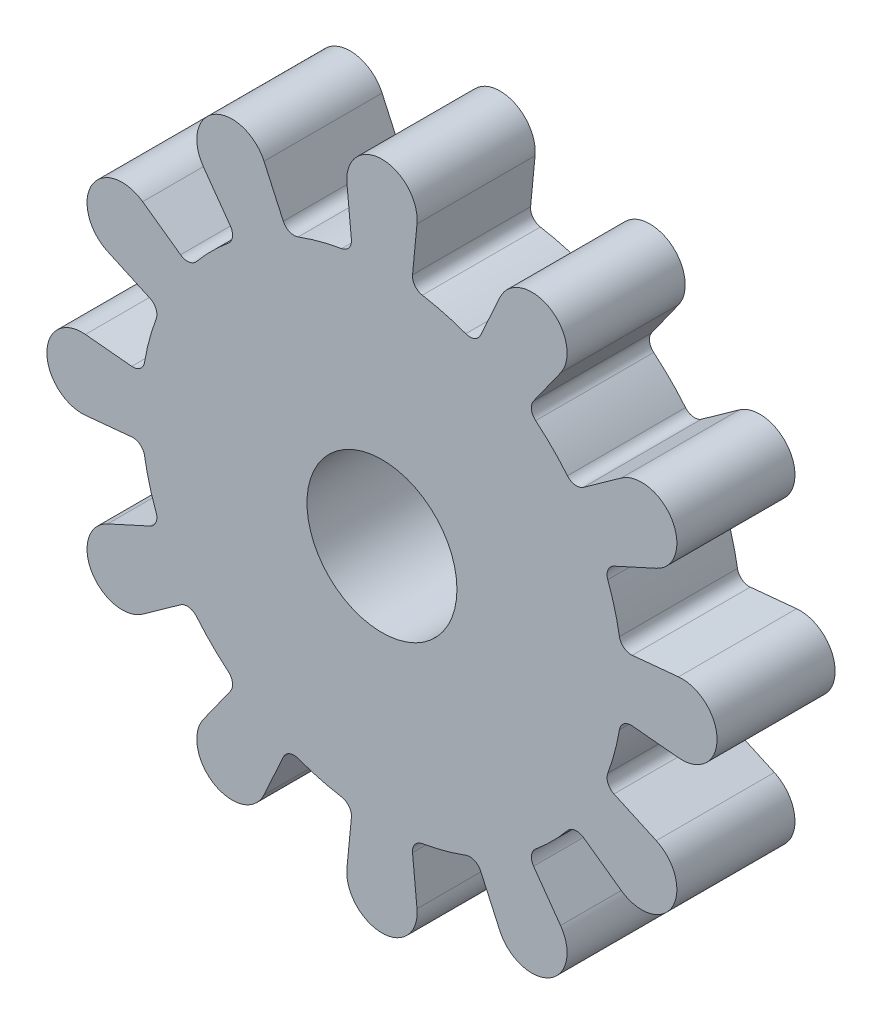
ISO-10303-21;
HEADER;
FILE_DESCRIPTION(('STEP AP214'),'2;1');
FILE_NAME('part.step','',(''),(''),'','','');
FILE_SCHEMA(('AUTOMOTIVE_DESIGN { 1 0 10303 214 1 1 1 1 }'));
ENDSEC;
DATA;
#1=APPLICATION_CONTEXT('core data for automotive mechanical design processes');
#2=APPLICATION_PROTOCOL_DEFINITION('international standard','automotive_design',2000,#1);
#3=PRODUCT_CONTEXT('',#1,'mechanical');
#4=PRODUCT('Part','Part','',(#3));
#5=PRODUCT_RELATED_PRODUCT_CATEGORY('part','',(#4));
#6=PRODUCT_DEFINITION_FORMATION('','',#4);
#7=PRODUCT_DEFINITION_CONTEXT('part definition',#1,'design');
#8=PRODUCT_DEFINITION('design','',#6,#7);
#9=PRODUCT_DEFINITION_SHAPE('','',#8);
#10=(LENGTH_UNIT() NAMED_UNIT(*) SI_UNIT(.MILLI.,.METRE.));
#11=(NAMED_UNIT(*) PLANE_ANGLE_UNIT() SI_UNIT($,.RADIAN.));
#12=(NAMED_UNIT(*) SI_UNIT($,.STERADIAN.) SOLID_ANGLE_UNIT());
#13=UNCERTAINTY_MEASURE_WITH_UNIT(LENGTH_MEASURE(1.E-05),#10,'distance_accuracy_value','');
#14=(GEOMETRIC_REPRESENTATION_CONTEXT(3) GLOBAL_UNCERTAINTY_ASSIGNED_CONTEXT((#13)) GLOBAL_UNIT_ASSIGNED_CONTEXT((#10,
#11,#12)) REPRESENTATION_CONTEXT('',''));
#15=CARTESIAN_POINT('',(0.,0.,0.));
#16=DIRECTION('',(0.,0.,1.));
#17=DIRECTION('',(1.,0.,0.));
#18=AXIS2_PLACEMENT_3D('',#15,#16,#17);
#19=CARTESIAN_POINT('',(-21.097722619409,-3.58414568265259,10.));
#20=DIRECTION('',(0.,0.,-1.));
#21=DIRECTION('',(-1.,0.,0.));
#22=AXIS2_PLACEMENT_3D('',#19,#20,#21);
#23=PLANE('',#22);
#24=CARTESIAN_POINT('',(-21.097722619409,-3.58414568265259,10.));
#25=DIRECTION('',(0.,0.,-1.));
#26=DIRECTION('',(-1.,0.,0.));
#27=AXIS2_PLACEMENT_3D('',#24,#25,#26);
#28=CIRCLE('',#27,0.99999999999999);
#29=CARTESIAN_POINT('',(-21.1935683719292,-2.58874948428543,10.));
#30=VERTEX_POINT('',#29);
#31=CARTESIAN_POINT('',(-20.1118477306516,-3.416662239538,10.));
#32=VERTEX_POINT('',#31);
#33=EDGE_CURVE('E652',#30,#32,#28,.T.);
#34=ORIENTED_EDGE('',*,*,#33,.T.);
#35=CARTESIAN_POINT('',(0.,0.,10.));
#36=DIRECTION('',(0.,0.,1.));
#37=DIRECTION('',(1.,0.,0.));
#38=AXIS2_PLACEMENT_3D('',#35,#36,#37);
#39=CIRCLE('',#38,20.4);
#40=CARTESIAN_POINT('',(-19.1257021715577,-7.09700756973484,10.));
#41=VERTEX_POINT('',#40);
#42=EDGE_CURVE('E280',#32,#41,#39,.T.);
#43=ORIENTED_EDGE('',*,*,#42,.T.);
#44=CARTESIAN_POINT('',(-20.0632365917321,-7.44490009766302,10.));
#45=DIRECTION('',(0.,0.,-1.));
#46=DIRECTION('',(1.,0.,0.));
#47=AXIS2_PLACEMENT_3D('',#44,#45,#46);
#48=CIRCLE('',#47,1.00000000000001);
#49=CARTESIAN_POINT('',(-19.6485433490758,-8.35486136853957,10.));
#50=VERTEX_POINT('',#49);
#51=EDGE_CURVE('E859',#41,#50,#48,.T.);
#52=ORIENTED_EDGE('',*,*,#51,.T.);
#53=DIRECTION('',(-0.90996127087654,-0.414693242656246,0.));
#54=VECTOR('',#53,1.);
#55=CARTESIAN_POINT('',(-19.6485433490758,-8.35486136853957,10.));
#56=LINE('',#55,#54);
#57=CARTESIAN_POINT('',(-23.2328311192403,-9.98831541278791,10.));
#58=VERTEX_POINT('',#57);
#59=EDGE_CURVE('E878',#50,#58,#56,.T.);
#60=ORIENTED_EDGE('',*,*,#59,.T.);
#61=CARTESIAN_POINT('',(-21.9970452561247,-12.7,10.));
#62=DIRECTION('',(0.,0.,1.));
#63=DIRECTION('',(1.,0.,0.));
#64=AXIS2_PLACEMENT_3D('',#61,#62,#63);
#65=CIRCLE('',#64,2.98);
#66=CARTESIAN_POINT('',(-20.2665504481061,-15.1260642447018,10.));
#67=VERTEX_POINT('',#66);
#68=EDGE_CURVE('E875',#58,#67,#65,.T.);
#69=ORIENTED_EDGE('',*,*,#68,.T.);
#70=DIRECTION('',(0.814115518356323,0.580702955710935,0.));
#71=VECTOR('',#70,1.);
#72=CARTESIAN_POINT('',(-17.0597938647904,-12.8387070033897,10.));
#73=LINE('',#72,#71);
#74=CARTESIAN_POINT('',(-17.0597938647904,-12.8387070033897,10.));
#75=VERTEX_POINT('',#74);
#76=EDGE_CURVE('E877',#67,#75,#73,.T.);
#77=ORIENTED_EDGE('',*,*,#76,.T.);
#78=CARTESIAN_POINT('',(-16.4790909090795,-13.652822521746,10.));
#79=DIRECTION('',(0.,0.,-1.));
#80=DIRECTION('',(-1.,0.,0.));
#81=AXIS2_PLACEMENT_3D('',#78,#79,#80);
#82=CIRCLE('',#81,0.999999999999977);
#83=CARTESIAN_POINT('',(-15.7090399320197,-13.0148401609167,10.));
#84=VERTEX_POINT('',#83);
#85=EDGE_CURVE('E880',#75,#84,#82,.T.);
#86=ORIENTED_EDGE('',*,*,#85,.T.);
#87=CARTESIAN_POINT('',(0.,0.,10.));
#88=DIRECTION('',(0.,0.,1.));
#89=DIRECTION('',(1.,0.,0.));
#90=AXIS2_PLACEMENT_3D('',#87,#88,#89);
#91=CIRCLE('',#90,20.4);
#92=CARTESIAN_POINT('',(-13.0148401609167,-15.7090399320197,10.));
#93=VERTEX_POINT('',#92);
#94=EDGE_CURVE('E886',#84,#93,#91,.T.);
#95=ORIENTED_EDGE('',*,*,#94,.T.);
#96=CARTESIAN_POINT('',(-13.652822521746,-16.4790909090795,10.));
#97=DIRECTION('',(0.,0.,-1.));
#98=DIRECTION('',(1.,0.,0.));
#99=AXIS2_PLACEMENT_3D('',#96,#97,#98);
#100=CIRCLE('',#99,1.00000000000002);
#101=CARTESIAN_POINT('',(-12.8387070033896,-17.0597938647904,10.));
#102=VERTEX_POINT('',#101);
#103=EDGE_CURVE('E888',#93,#102,#100,.T.);
#104=ORIENTED_EDGE('',*,*,#103,.T.);
#105=DIRECTION('',(-0.580702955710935,-0.814115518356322,0.));
#106=VECTOR('',#105,1.);
#107=CARTESIAN_POINT('',(-12.8387070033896,-17.0597938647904,10.));
#108=LINE('',#107,#106);
#109=CARTESIAN_POINT('',(-15.1260642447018,-20.2665504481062,10.));
#110=VERTEX_POINT('',#109);
#111=EDGE_CURVE('E890',#102,#110,#108,.T.);
#112=ORIENTED_EDGE('',*,*,#111,.T.);
#113=CARTESIAN_POINT('',(-12.7,-21.9970452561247,10.));
#114=DIRECTION('',(0.,0.,1.));
#115=DIRECTION('',(1.,0.,0.));
#116=AXIS2_PLACEMENT_3D('',#113,#114,#115);
#117=CIRCLE('',#116,2.98);
#118=CARTESIAN_POINT('',(-9.98831541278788,-23.2328311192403,10.));
#119=VERTEX_POINT('',#118);
#120=EDGE_CURVE('E892',#110,#119,#117,.T.);
#121=ORIENTED_EDGE('',*,*,#120,.T.);
#122=DIRECTION('',(0.414693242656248,0.909961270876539,0.));
#123=VECTOR('',#122,1.);
#124=CARTESIAN_POINT('',(-8.35486136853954,-19.6485433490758,10.));
#125=LINE('',#124,#123);
#126=CARTESIAN_POINT('',(-8.35486136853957,-19.6485433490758,10.));
#127=VERTEX_POINT('',#126);
#128=EDGE_CURVE('E894',#119,#127,#125,.T.);
#129=ORIENTED_EDGE('',*,*,#128,.T.);
#130=CARTESIAN_POINT('',(-7.44490009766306,-20.0632365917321,10.));
#131=DIRECTION('',(0.,0.,-1.));
#132=DIRECTION('',(-1.,0.,0.));
#133=AXIS2_PLACEMENT_3D('',#130,#131,#132);
#134=CIRCLE('',#133,0.999999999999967);
#135=CARTESIAN_POINT('',(-7.09700756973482,-19.1257021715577,10.));
#136=VERTEX_POINT('',#135);
#137=EDGE_CURVE('E896',#127,#136,#134,.T.);
#138=ORIENTED_EDGE('',*,*,#137,.T.);
#139=CARTESIAN_POINT('',(0.,0.,10.));
#140=DIRECTION('',(0.,0.,1.));
#141=DIRECTION('',(1.,0.,0.));
#142=AXIS2_PLACEMENT_3D('',#139,#140,#141);
#143=CIRCLE('',#142,20.4);
#144=CARTESIAN_POINT('',(-3.41666223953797,-20.1118477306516,10.));
#145=VERTEX_POINT('',#144);
#146=EDGE_CURVE('E898',#136,#145,#143,.T.);
#147=ORIENTED_EDGE('',*,*,#146,.T.);
#148=CARTESIAN_POINT('',(-3.58414568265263,-21.097722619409,10.));
#149=DIRECTION('',(0.,0.,-1.));
#150=DIRECTION('',(1.,0.,0.));
#151=AXIS2_PLACEMENT_3D('',#148,#149,#150);
#152=CIRCLE('',#151,1.00000000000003);
#153=CARTESIAN_POINT('',(-2.5887494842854,-21.1935683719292,10.));
#154=VERTEX_POINT('',#153);
#155=EDGE_CURVE('E900',#145,#154,#152,.T.);
#156=ORIENTED_EDGE('',*,*,#155,.T.);
#157=DIRECTION('',(-0.0958457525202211,-0.995396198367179,0.));
#158=VECTOR('',#157,1.);
#159=CARTESIAN_POINT('',(-2.5887494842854,-21.1935683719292,10.));
#160=LINE('',#159,#158);
#161=CARTESIAN_POINT('',(-2.96628067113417,-25.1143796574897,10.));
#162=VERTEX_POINT('',#161);
#163=EDGE_CURVE('E902',#154,#162,#160,.T.);
#164=ORIENTED_EDGE('',*,*,#163,.T.);
#165=CARTESIAN_POINT('',(0.,-25.4,10.));
#166=DIRECTION('',(0.,0.,1.));
#167=DIRECTION('',(1.,0.,0.));
#168=AXIS2_PLACEMENT_3D('',#165,#166,#167);
#169=CIRCLE('',#168,2.98);
#170=CARTESIAN_POINT('',(2.96628067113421,-25.1143796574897,10.));
#171=VERTEX_POINT('',#170);
#172=EDGE_CURVE('E904',#162,#171,#169,.T.);
#173=ORIENTED_EDGE('',*,*,#172,.T.);
#174=DIRECTION('',(-0.0958457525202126,0.99539619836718,0.));
#175=VECTOR('',#174,1.);
#176=CARTESIAN_POINT('',(2.58874948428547,-21.1935683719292,10.));
#177=LINE('',#176,#175);
#178=CARTESIAN_POINT('',(2.58874948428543,-21.1935683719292,10.));
#179=VERTEX_POINT('',#178);
#180=EDGE_CURVE('E906',#171,#179,#177,.T.);
#181=ORIENTED_EDGE('',*,*,#180,.T.);
#182=CARTESIAN_POINT('',(3.58414568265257,-21.097722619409,10.));
#183=DIRECTION('',(0.,0.,-1.));
#184=DIRECTION('',(-1.,0.,0.));
#185=AXIS2_PLACEMENT_3D('',#182,#183,#184);
#186=CIRCLE('',#185,0.999999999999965);
#187=CARTESIAN_POINT('',(3.41666223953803,-20.1118477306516,10.));
#188=VERTEX_POINT('',#187);
#189=EDGE_CURVE('E908',#179,#188,#186,.T.);
#190=ORIENTED_EDGE('',*,*,#189,.T.);
#191=CARTESIAN_POINT('',(0.,0.,10.));
#192=DIRECTION('',(0.,0.,1.));
#193=DIRECTION('',(1.,0.,0.));
#194=AXIS2_PLACEMENT_3D('',#191,#192,#193);
#195=CIRCLE('',#194,20.4);
#196=CARTESIAN_POINT('',(7.09700756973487,-19.1257021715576,10.));
#197=VERTEX_POINT('',#196);
#198=EDGE_CURVE('E910',#188,#197,#195,.T.);
#199=ORIENTED_EDGE('',*,*,#198,.T.);
#200=CARTESIAN_POINT('',(7.44490009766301,-20.0632365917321,10.));
#201=DIRECTION('',(0.,0.,-1.));
#202=DIRECTION('',(1.,0.,0.));
#203=AXIS2_PLACEMENT_3D('',#200,#201,#202);
#204=CIRCLE('',#203,1.00000000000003);
#205=CARTESIAN_POINT('',(8.35486136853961,-19.6485433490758,10.));
#206=VERTEX_POINT('',#205);
#207=EDGE_CURVE('E912',#197,#206,#204,.T.);
#208=ORIENTED_EDGE('',*,*,#207,.T.);
#209=DIRECTION('',(0.414693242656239,-0.909961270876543,0.));
#210=VECTOR('',#209,1.);
#211=CARTESIAN_POINT('',(8.35486136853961,-19.6485433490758,10.));
#212=LINE('',#211,#210);
#213=CARTESIAN_POINT('',(9.98831541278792,-23.2328311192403,10.));
#214=VERTEX_POINT('',#213);
#215=EDGE_CURVE('E914',#206,#214,#212,.T.);
#216=ORIENTED_EDGE('',*,*,#215,.T.);
#217=CARTESIAN_POINT('',(12.7,-21.9970452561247,10.));
#218=DIRECTION('',(0.,0.,1.));
#219=DIRECTION('',(1.,0.,0.));
#220=AXIS2_PLACEMENT_3D('',#217,#218,#219);
#221=CIRCLE('',#220,2.98);
#222=CARTESIAN_POINT('',(15.1260642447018,-20.2665504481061,10.));
#223=VERTEX_POINT('',#222);
#224=EDGE_CURVE('E916',#214,#223,#221,.T.);
#225=ORIENTED_EDGE('',*,*,#224,.T.);
#226=DIRECTION('',(-0.580702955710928,0.814115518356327,0.));
#227=VECTOR('',#226,1.);
#228=CARTESIAN_POINT('',(12.8387070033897,-17.0597938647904,10.));
#229=LINE('',#228,#227);
#230=CARTESIAN_POINT('',(12.8387070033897,-17.0597938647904,10.));
#231=VERTEX_POINT('',#230);
#232=EDGE_CURVE('E918',#223,#231,#229,.T.);
#233=ORIENTED_EDGE('',*,*,#232,.T.);
#234=CARTESIAN_POINT('',(13.652822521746,-16.4790909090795,10.));
#235=DIRECTION('',(0.,0.,-1.));
#236=DIRECTION('',(-1.,0.,0.));
#237=AXIS2_PLACEMENT_3D('',#234,#235,#236);
#238=CIRCLE('',#237,0.999999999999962);
#239=CARTESIAN_POINT('',(13.0148401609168,-15.7090399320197,10.));
#240=VERTEX_POINT('',#239);
#241=EDGE_CURVE('E920',#231,#240,#238,.T.);
#242=ORIENTED_EDGE('',*,*,#241,.T.);
#243=CARTESIAN_POINT('',(0.,0.,10.));
#244=DIRECTION('',(0.,0.,1.));
#245=DIRECTION('',(1.,0.,0.));
#246=AXIS2_PLACEMENT_3D('',#243,#244,#245);
#247=CIRCLE('',#246,20.4);
#248=CARTESIAN_POINT('',(15.7090399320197,-13.0148401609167,10.));
#249=VERTEX_POINT('',#248);
#250=EDGE_CURVE('E922',#240,#249,#247,.T.);
#251=ORIENTED_EDGE('',*,*,#250,.T.);
#252=CARTESIAN_POINT('',(16.4790909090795,-13.652822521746,10.));
#253=DIRECTION('',(0.,0.,-1.));
#254=DIRECTION('',(1.,0.,0.));
#255=AXIS2_PLACEMENT_3D('',#252,#253,#254);
#256=CIRCLE('',#255,1.00000000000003);
#257=CARTESIAN_POINT('',(17.0597938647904,-12.8387070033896,10.));
#258=VERTEX_POINT('',#257);
#259=EDGE_CURVE('E924',#249,#258,#256,.T.);
#260=ORIENTED_EDGE('',*,*,#259,.T.);
#261=DIRECTION('',(0.814115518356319,-0.58070295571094,0.));
#262=VECTOR('',#261,1.);
#263=CARTESIAN_POINT('',(17.0597938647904,-12.8387070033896,10.));
#264=LINE('',#263,#262);
#265=CARTESIAN_POINT('',(20.2665504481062,-15.1260642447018,10.));
#266=VERTEX_POINT('',#265);
#267=EDGE_CURVE('E926',#258,#266,#264,.T.);
#268=ORIENTED_EDGE('',*,*,#267,.T.);
#269=CARTESIAN_POINT('',(21.9970452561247,-12.7,10.));
#270=DIRECTION('',(0.,0.,1.));
#271=DIRECTION('',(1.,0.,0.));
#272=AXIS2_PLACEMENT_3D('',#269,#270,#271);
#273=CIRCLE('',#272,2.98);
#274=CARTESIAN_POINT('',(23.2328311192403,-9.98831541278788,10.));
#275=VERTEX_POINT('',#274);
#276=EDGE_CURVE('E928',#266,#275,#273,.T.);
#277=ORIENTED_EDGE('',*,*,#276,.T.);
#278=DIRECTION('',(-0.909961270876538,0.414693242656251,0.));
#279=VECTOR('',#278,1.);
#280=CARTESIAN_POINT('',(19.6485433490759,-8.35486136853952,10.));
#281=LINE('',#280,#279);
#282=CARTESIAN_POINT('',(19.6485433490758,-8.35486136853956,10.));
#283=VERTEX_POINT('',#282);
#284=EDGE_CURVE('E930',#275,#283,#281,.T.);
#285=ORIENTED_EDGE('',*,*,#284,.T.);
#286=CARTESIAN_POINT('',(20.0632365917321,-7.44490009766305,10.));
#287=DIRECTION('',(0.,0.,-1.));
#288=DIRECTION('',(-1.,0.,0.));
#289=AXIS2_PLACEMENT_3D('',#286,#287,#288);
#290=CIRCLE('',#289,0.999999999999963);
#291=CARTESIAN_POINT('',(19.1257021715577,-7.09700756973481,10.));
#292=VERTEX_POINT('',#291);
#293=EDGE_CURVE('E932',#283,#292,#290,.T.);
#294=ORIENTED_EDGE('',*,*,#293,.T.);
#295=CARTESIAN_POINT('',(0.,0.,10.));
#296=DIRECTION('',(0.,0.,1.));
#297=DIRECTION('',(1.,0.,0.));
#298=AXIS2_PLACEMENT_3D('',#295,#296,#297);
#299=CIRCLE('',#298,20.4);
#300=CARTESIAN_POINT('',(20.1118477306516,-3.41666223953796,10.));
#301=VERTEX_POINT('',#300);
#302=EDGE_CURVE('E934',#292,#301,#299,.T.);
#303=ORIENTED_EDGE('',*,*,#302,.T.);
#304=CARTESIAN_POINT('',(21.097722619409,-3.58414568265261,10.));
#305=DIRECTION('',(0.,0.,-1.));
#306=DIRECTION('',(1.,0.,0.));
#307=AXIS2_PLACEMENT_3D('',#304,#305,#306);
#308=CIRCLE('',#307,1.00000000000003);
#309=CARTESIAN_POINT('',(21.1935683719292,-2.58874948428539,10.));
#310=VERTEX_POINT('',#309);
#311=EDGE_CURVE('E936',#301,#310,#308,.T.);
#312=ORIENTED_EDGE('',*,*,#311,.T.);
#313=DIRECTION('',(0.995396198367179,-0.0958457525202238,0.));
#314=VECTOR('',#313,1.);
#315=CARTESIAN_POINT('',(21.1935683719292,-2.58874948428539,10.));
#316=LINE('',#315,#314);
#317=CARTESIAN_POINT('',(25.1143796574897,-2.96628067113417,10.));
#318=VERTEX_POINT('',#317);
#319=EDGE_CURVE('E938',#310,#318,#316,.T.);
#320=ORIENTED_EDGE('',*,*,#319,.T.);
#321=CARTESIAN_POINT('',(25.4,0.,10.));
#322=DIRECTION('',(0.,0.,1.));
#323=DIRECTION('',(1.,0.,0.));
#324=AXIS2_PLACEMENT_3D('',#321,#322,#323);
#325=CIRCLE('',#324,2.98);
#326=CARTESIAN_POINT('',(25.1143796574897,2.96628067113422,10.));
#327=VERTEX_POINT('',#326);
#328=EDGE_CURVE('E940',#318,#327,#325,.T.);
#329=ORIENTED_EDGE('',*,*,#328,.T.);
#330=DIRECTION('',(-0.99539619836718,-0.0958457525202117,0.));
#331=VECTOR('',#330,1.);
#332=CARTESIAN_POINT('',(21.1935683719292,2.58874948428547,10.));
#333=LINE('',#332,#331);
#334=CARTESIAN_POINT('',(21.1935683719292,2.58874948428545,10.));
#335=VERTEX_POINT('',#334);
#336=EDGE_CURVE('E942',#327,#335,#333,.T.);
#337=ORIENTED_EDGE('',*,*,#336,.T.);
#338=CARTESIAN_POINT('',(21.097722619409,3.5841456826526,10.));
#339=DIRECTION('',(0.,0.,-1.));
#340=DIRECTION('',(-1.,0.,0.));
#341=AXIS2_PLACEMENT_3D('',#338,#339,#340);
#342=CIRCLE('',#341,0.999999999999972);
#343=CARTESIAN_POINT('',(20.1118477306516,3.41666223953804,10.));
#344=VERTEX_POINT('',#343);
#345=EDGE_CURVE('E944',#335,#344,#342,.T.);
#346=ORIENTED_EDGE('',*,*,#345,.T.);
#347=CARTESIAN_POINT('',(0.,0.,10.));
#348=DIRECTION('',(0.,0.,1.));
#349=DIRECTION('',(1.,0.,0.));
#350=AXIS2_PLACEMENT_3D('',#347,#348,#349);
#351=CIRCLE('',#350,20.4);
#352=CARTESIAN_POINT('',(19.1257021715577,7.09700756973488,10.));
#353=VERTEX_POINT('',#352);
#354=EDGE_CURVE('E946',#344,#353,#351,.T.);
#355=ORIENTED_EDGE('',*,*,#354,.T.);
#356=CARTESIAN_POINT('',(20.0632365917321,7.44490009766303,10.));
#357=DIRECTION('',(0.,0.,-1.));
#358=DIRECTION('',(1.,0.,0.));
#359=AXIS2_PLACEMENT_3D('',#356,#357,#358);
#360=CIRCLE('',#359,1.00000000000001);
#361=CARTESIAN_POINT('',(19.6485433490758,8.3548613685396,10.));
#362=VERTEX_POINT('',#361);
#363=EDGE_CURVE('E948',#353,#362,#360,.T.);
#364=ORIENTED_EDGE('',*,*,#363,.T.);
#365=DIRECTION('',(0.90996127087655,0.414693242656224,0.));
#366=VECTOR('',#365,1.);
#367=CARTESIAN_POINT('',(19.6485433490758,8.3548613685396,10.));
#368=LINE('',#367,#366);
#369=CARTESIAN_POINT('',(23.2328311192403,9.98831541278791,10.));
#370=VERTEX_POINT('',#369);
#371=EDGE_CURVE('E950',#362,#370,#368,.T.);
#372=ORIENTED_EDGE('',*,*,#371,.T.);
#373=CARTESIAN_POINT('',(21.9970452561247,12.7,10.));
#374=DIRECTION('',(0.,0.,1.));
#375=DIRECTION('',(1.,0.,0.));
#376=AXIS2_PLACEMENT_3D('',#373,#374,#375);
#377=CIRCLE('',#376,2.98);
#378=CARTESIAN_POINT('',(20.2665504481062,15.1260642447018,10.));
#379=VERTEX_POINT('',#378);
#380=EDGE_CURVE('E952',#370,#379,#377,.T.);
#381=ORIENTED_EDGE('',*,*,#380,.T.);
#382=DIRECTION('',(-0.814115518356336,-0.580702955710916,0.));
#383=VECTOR('',#382,1.);
#384=CARTESIAN_POINT('',(17.0597938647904,12.8387070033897,10.));
#385=LINE('',#384,#383);
#386=CARTESIAN_POINT('',(17.0597938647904,12.8387070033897,10.));
#387=VERTEX_POINT('',#386);
#388=EDGE_CURVE('E954',#379,#387,#385,.T.);
#389=ORIENTED_EDGE('',*,*,#388,.T.);
#390=CARTESIAN_POINT('',(16.4790909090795,13.652822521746,10.));
#391=DIRECTION('',(0.,0.,-1.));
#392=DIRECTION('',(-1.,0.,0.));
#393=AXIS2_PLACEMENT_3D('',#390,#391,#392);
#394=CIRCLE('',#393,0.999999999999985);
#395=CARTESIAN_POINT('',(15.7090399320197,13.0148401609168,10.));
#396=VERTEX_POINT('',#395);
#397=EDGE_CURVE('E956',#387,#396,#394,.T.);
#398=ORIENTED_EDGE('',*,*,#397,.T.);
#399=CARTESIAN_POINT('',(0.,0.,10.));
#400=DIRECTION('',(0.,0.,1.));
#401=DIRECTION('',(1.,0.,0.));
#402=AXIS2_PLACEMENT_3D('',#399,#400,#401);
#403=CIRCLE('',#402,20.4);
#404=CARTESIAN_POINT('',(13.0148401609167,15.7090399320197,10.));
#405=VERTEX_POINT('',#404);
#406=EDGE_CURVE('E958',#396,#405,#403,.T.);
#407=ORIENTED_EDGE('',*,*,#406,.T.);
#408=CARTESIAN_POINT('',(13.652822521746,16.4790909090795,10.));
#409=DIRECTION('',(0.,0.,-1.));
#410=DIRECTION('',(1.,0.,0.));
#411=AXIS2_PLACEMENT_3D('',#408,#409,#410);
#412=CIRCLE('',#411,0.999999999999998);
#413=CARTESIAN_POINT('',(12.8387070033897,17.0597938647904,10.));
#414=VERTEX_POINT('',#413);
#415=EDGE_CURVE('E960',#405,#414,#412,.T.);
#416=ORIENTED_EDGE('',*,*,#415,.T.);
#417=DIRECTION('',(0.58070295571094,0.814115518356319,0.));
#418=VECTOR('',#417,1.);
#419=CARTESIAN_POINT('',(12.8387070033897,17.0597938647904,10.));
#420=LINE('',#419,#418);
#421=CARTESIAN_POINT('',(15.1260642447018,20.2665504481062,10.));
#422=VERTEX_POINT('',#421);
#423=EDGE_CURVE('E962',#414,#422,#420,.T.);
#424=ORIENTED_EDGE('',*,*,#423,.T.);
#425=CARTESIAN_POINT('',(12.7,21.9970452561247,10.));
#426=DIRECTION('',(0.,0.,1.));
#427=DIRECTION('',(1.,0.,0.));
#428=AXIS2_PLACEMENT_3D('',#425,#426,#427);
#429=CIRCLE('',#428,2.98);
#430=CARTESIAN_POINT('',(9.98831541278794,23.2328311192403,10.));
#431=VERTEX_POINT('',#430);
#432=EDGE_CURVE('E964',#422,#431,#429,.T.);
#433=ORIENTED_EDGE('',*,*,#432,.T.);
#434=DIRECTION('',(-0.41469324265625,-0.909961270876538,0.));
#435=VECTOR('',#434,1.);
#436=CARTESIAN_POINT('',(8.35486136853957,19.6485433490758,10.));
#437=LINE('',#436,#435);
#438=CARTESIAN_POINT('',(8.35486136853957,19.6485433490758,10.));
#439=VERTEX_POINT('',#438);
#440=EDGE_CURVE('E966',#431,#439,#437,.T.);
#441=ORIENTED_EDGE('',*,*,#440,.T.);
#442=CARTESIAN_POINT('',(7.44490009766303,20.0632365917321,10.));
#443=DIRECTION('',(0.,0.,-1.));
#444=DIRECTION('',(-1.,0.,0.));
#445=AXIS2_PLACEMENT_3D('',#442,#443,#444);
#446=CIRCLE('',#445,1.);
#447=CARTESIAN_POINT('',(7.09700756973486,19.1257021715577,10.));
#448=VERTEX_POINT('',#447);
#449=EDGE_CURVE('E968',#439,#448,#446,.T.);
#450=ORIENTED_EDGE('',*,*,#449,.T.);
#451=CARTESIAN_POINT('',(0.,0.,10.));
#452=DIRECTION('',(0.,0.,1.));
#453=DIRECTION('',(1.,0.,0.));
#454=AXIS2_PLACEMENT_3D('',#451,#452,#453);
#455=CIRCLE('',#454,20.4);
#456=CARTESIAN_POINT('',(3.416662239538,20.1118477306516,10.));
#457=VERTEX_POINT('',#456);
#458=EDGE_CURVE('E970',#448,#457,#455,.T.);
#459=ORIENTED_EDGE('',*,*,#458,.T.);
#460=CARTESIAN_POINT('',(3.58414568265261,21.097722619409,10.));
#461=DIRECTION('',(0.,0.,-1.));
#462=DIRECTION('',(1.,0.,0.));
#463=AXIS2_PLACEMENT_3D('',#460,#461,#462);
#464=CIRCLE('',#463,1.);
#465=CARTESIAN_POINT('',(2.58874948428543,21.1935683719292,10.));
#466=VERTEX_POINT('',#465);
#467=EDGE_CURVE('E972',#457,#466,#464,.T.);
#468=ORIENTED_EDGE('',*,*,#467,.T.);
#469=DIRECTION('',(0.0958457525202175,0.995396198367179,0.));
#470=VECTOR('',#469,1.);
#471=CARTESIAN_POINT('',(2.58874948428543,21.1935683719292,10.));
#472=LINE('',#471,#470);
#473=CARTESIAN_POINT('',(2.9662806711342,25.1143796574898,10.));
#474=VERTEX_POINT('',#473);
#475=EDGE_CURVE('E974',#466,#474,#472,.T.);
#476=ORIENTED_EDGE('',*,*,#475,.T.);
#477=CARTESIAN_POINT('',(0.,25.4,10.));
#478=DIRECTION('',(0.,0.,1.));
#479=DIRECTION('',(1.,0.,0.));
#480=AXIS2_PLACEMENT_3D('',#477,#478,#479);
#481=CIRCLE('',#480,2.98);
#482=CARTESIAN_POINT('',(-2.9662806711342,25.1143796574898,10.));
#483=VERTEX_POINT('',#482);
#484=EDGE_CURVE('E976',#474,#483,#481,.T.);
#485=ORIENTED_EDGE('',*,*,#484,.T.);
#486=DIRECTION('',(0.0958457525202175,-0.995396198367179,0.));
#487=VECTOR('',#486,1.);
#488=CARTESIAN_POINT('',(-2.58874948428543,21.1935683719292,10.));
#489=LINE('',#488,#487);
#490=CARTESIAN_POINT('',(-2.58874948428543,21.1935683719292,10.));
#491=VERTEX_POINT('',#490);
#492=EDGE_CURVE('E978',#483,#491,#489,.T.);
#493=ORIENTED_EDGE('',*,*,#492,.T.);
#494=CARTESIAN_POINT('',(-3.58414568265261,21.097722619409,10.));
#495=DIRECTION('',(0.,0.,-1.));
#496=DIRECTION('',(-1.,0.,0.));
#497=AXIS2_PLACEMENT_3D('',#494,#495,#496);
#498=CIRCLE('',#497,1.);
#499=CARTESIAN_POINT('',(-3.416662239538,20.1118477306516,10.));
#500=VERTEX_POINT('',#499);
#501=EDGE_CURVE('E980',#491,#500,#498,.T.);
#502=ORIENTED_EDGE('',*,*,#501,.T.);
#503=CARTESIAN_POINT('',(0.,0.,10.));
#504=DIRECTION('',(0.,0.,1.));
#505=DIRECTION('',(1.,0.,0.));
#506=AXIS2_PLACEMENT_3D('',#503,#504,#505);
#507=CIRCLE('',#506,20.4);
#508=CARTESIAN_POINT('',(-7.09700756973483,19.1257021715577,10.));
#509=VERTEX_POINT('',#508);
#510=EDGE_CURVE('E982',#500,#509,#507,.T.);
#511=ORIENTED_EDGE('',*,*,#510,.T.);
#512=CARTESIAN_POINT('',(-7.44490009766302,20.0632365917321,10.));
#513=DIRECTION('',(0.,0.,-1.));
#514=DIRECTION('',(1.,0.,0.));
#515=AXIS2_PLACEMENT_3D('',#512,#513,#514);
#516=CIRCLE('',#515,0.999999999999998);
#517=CARTESIAN_POINT('',(-8.35486136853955,19.6485433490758,10.));
#518=VERTEX_POINT('',#517);
#519=EDGE_CURVE('E984',#509,#518,#516,.T.);
#520=ORIENTED_EDGE('',*,*,#519,.T.);
#521=DIRECTION('',(-0.414693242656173,0.909961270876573,0.));
#522=VECTOR('',#521,1.);
#523=CARTESIAN_POINT('',(-8.35486136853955,19.6485433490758,10.));
#524=LINE('',#523,#522);
#525=CARTESIAN_POINT('',(-9.98831541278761,23.2328311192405,10.));
#526=VERTEX_POINT('',#525);
#527=EDGE_CURVE('E986',#518,#526,#524,.T.);
#528=ORIENTED_EDGE('',*,*,#527,.T.);
#529=CARTESIAN_POINT('',(-12.6999999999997,21.9970452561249,10.));
#530=DIRECTION('',(0.,0.,1.));
#531=DIRECTION('',(1.,0.,0.));
#532=AXIS2_PLACEMENT_3D('',#529,#530,#531);
#533=CIRCLE('',#532,2.98);
#534=CARTESIAN_POINT('',(-15.1260642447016,20.2665504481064,10.));
#535=VERTEX_POINT('',#534);
#536=EDGE_CURVE('E988',#526,#535,#533,.T.);
#537=ORIENTED_EDGE('',*,*,#536,.T.);
#538=DIRECTION('',(0.580702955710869,-0.81411551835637,0.));
#539=VECTOR('',#538,1.);
#540=CARTESIAN_POINT('',(-12.8387070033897,17.0597938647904,10.));
#541=LINE('',#540,#539);
#542=CARTESIAN_POINT('',(-12.8387070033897,17.0597938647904,10.));
#543=VERTEX_POINT('',#542);
#544=EDGE_CURVE('E990',#535,#543,#541,.T.);
#545=ORIENTED_EDGE('',*,*,#544,.T.);
#546=CARTESIAN_POINT('',(-13.652822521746,16.4790909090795,10.));
#547=DIRECTION('',(0.,0.,-1.));
#548=DIRECTION('',(-1.,0.,0.));
#549=AXIS2_PLACEMENT_3D('',#546,#547,#548);
#550=CIRCLE('',#549,1.);
#551=CARTESIAN_POINT('',(-13.0148401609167,15.7090399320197,10.));
#552=VERTEX_POINT('',#551);
#553=EDGE_CURVE('E992',#543,#552,#550,.T.);
#554=ORIENTED_EDGE('',*,*,#553,.T.);
#555=CARTESIAN_POINT('',(0.,0.,10.));
#556=DIRECTION('',(0.,0.,1.));
#557=DIRECTION('',(1.,0.,0.));
#558=AXIS2_PLACEMENT_3D('',#555,#556,#557);
#559=CIRCLE('',#558,20.4);
#560=CARTESIAN_POINT('',(-15.7090399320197,13.0148401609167,10.));
#561=VERTEX_POINT('',#560);
#562=EDGE_CURVE('E994',#552,#561,#559,.T.);
#563=ORIENTED_EDGE('',*,*,#562,.T.);
#564=CARTESIAN_POINT('',(-16.4790909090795,13.652822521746,10.));
#565=DIRECTION('',(0.,0.,-1.));
#566=DIRECTION('',(1.,0.,0.));
#567=AXIS2_PLACEMENT_3D('',#564,#565,#566);
#568=CIRCLE('',#567,0.999999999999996);
#569=CARTESIAN_POINT('',(-17.0597938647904,12.8387070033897,10.));
#570=VERTEX_POINT('',#569);
#571=EDGE_CURVE('E996',#561,#570,#568,.T.);
#572=ORIENTED_EDGE('',*,*,#571,.T.);
#573=DIRECTION('',(-0.81411551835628,0.580702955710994,0.));
#574=VECTOR('',#573,1.);
#575=CARTESIAN_POINT('',(-17.0597938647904,12.8387070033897,10.));
#576=LINE('',#575,#574);
#577=CARTESIAN_POINT('',(-20.266550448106,15.1260642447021,10.));
#578=VERTEX_POINT('',#577);
#579=EDGE_CURVE('E998',#570,#578,#576,.T.);
#580=ORIENTED_EDGE('',*,*,#579,.T.);
#581=CARTESIAN_POINT('',(-21.9970452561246,12.7000000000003,10.));
#582=DIRECTION('',(0.,0.,1.));
#583=DIRECTION('',(1.,0.,0.));
#584=AXIS2_PLACEMENT_3D('',#581,#582,#583);
#585=CIRCLE('',#584,2.98);
#586=CARTESIAN_POINT('',(-23.2328311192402,9.98831541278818,10.));
#587=VERTEX_POINT('',#586);
#588=EDGE_CURVE('E1000',#578,#587,#585,.T.);
#589=ORIENTED_EDGE('',*,*,#588,.T.);
#590=DIRECTION('',(0.909961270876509,-0.414693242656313,0.));
#591=VECTOR('',#590,1.);
#592=CARTESIAN_POINT('',(-19.6485433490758,8.35486136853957,10.));
#593=LINE('',#592,#591);
#594=CARTESIAN_POINT('',(-19.6485433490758,8.35486136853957,10.));
#595=VERTEX_POINT('',#594);
#596=EDGE_CURVE('E1002',#587,#595,#593,.T.);
#597=ORIENTED_EDGE('',*,*,#596,.T.);
#598=CARTESIAN_POINT('',(-20.0632365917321,7.44490009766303,10.));
#599=DIRECTION('',(0.,0.,-1.));
#600=DIRECTION('',(-1.,0.,0.));
#601=AXIS2_PLACEMENT_3D('',#598,#599,#600);
#602=CIRCLE('',#601,0.999999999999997);
#603=CARTESIAN_POINT('',(-19.1257021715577,7.09700756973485,10.));
#604=VERTEX_POINT('',#603);
#605=EDGE_CURVE('E1004',#595,#604,#602,.T.);
#606=ORIENTED_EDGE('',*,*,#605,.T.);
#607=CARTESIAN_POINT('',(0.,0.,10.));
#608=DIRECTION('',(0.,0.,1.));
#609=DIRECTION('',(1.,0.,0.));
#610=AXIS2_PLACEMENT_3D('',#607,#608,#609);
#611=CIRCLE('',#610,20.4);
#612=CARTESIAN_POINT('',(-20.1118477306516,3.41666223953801,10.));
#613=VERTEX_POINT('',#612);
#614=EDGE_CURVE('E1006',#604,#613,#611,.T.);
#615=ORIENTED_EDGE('',*,*,#614,.T.);
#616=CARTESIAN_POINT('',(-21.097722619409,3.58414568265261,10.));
#617=DIRECTION('',(0.,0.,-1.));
#618=DIRECTION('',(1.,0.,0.));
#619=AXIS2_PLACEMENT_3D('',#616,#617,#618);
#620=CIRCLE('',#619,1.);
#621=CARTESIAN_POINT('',(-21.1935683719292,2.58874948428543,10.));
#622=VERTEX_POINT('',#621);
#623=EDGE_CURVE('E491',#613,#622,#620,.T.);
#624=ORIENTED_EDGE('',*,*,#623,.T.);
#625=DIRECTION('',(-0.995396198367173,0.0958457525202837,0.));
#626=VECTOR('',#625,1.);
#627=CARTESIAN_POINT('',(-21.1935683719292,2.58874948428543,10.));
#628=LINE('',#627,#626);
#629=CARTESIAN_POINT('',(-25.1143796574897,2.96628067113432,10.));
#630=VERTEX_POINT('',#629);
#631=EDGE_CURVE('E485',#622,#630,#628,.T.);
#632=ORIENTED_EDGE('',*,*,#631,.T.);
#633=CARTESIAN_POINT('',(-25.4,0.,10.));
#634=DIRECTION('',(0.,0.,1.));
#635=DIRECTION('',(1.,0.,0.));
#636=AXIS2_PLACEMENT_3D('',#633,#634,#635);
#637=CIRCLE('',#636,2.98000000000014);
#638=CARTESIAN_POINT('',(-25.1143796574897,-2.96628067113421,10.));
#639=VERTEX_POINT('',#638);
#640=EDGE_CURVE('E489',#630,#639,#637,.T.);
#641=ORIENTED_EDGE('',*,*,#640,.T.);
#642=DIRECTION('',(0.995396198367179,0.0958457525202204,0.));
#643=VECTOR('',#642,1.);
#644=CARTESIAN_POINT('',(-21.1935683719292,-2.58874948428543,10.));
#645=LINE('',#644,#643);
#646=EDGE_CURVE('E45',#639,#30,#645,.T.);
#647=ORIENTED_EDGE('',*,*,#646,.T.);
#648=EDGE_LOOP('',(#34,#43,#52,#60,#69,#77,#86,#95,#104,#112,#121,#129,#138,#147,#156,#164,#173,
#181,#190,#199,#208,#216,#225,#233,#242,#251,#260,#268,#277,#285,#294,#303,#312,#320,#329,#337,
#346,#355,#364,#372,#381,#389,#398,#407,#416,#424,#433,#441,#450,#459,#468,#476,#485,#493,#502,
#511,#520,#528,#537,#545,#554,#563,#572,#580,#589,#597,#606,#615,#624,#632,#641,#647));
#649=FACE_BOUND('',#648,.T.);
#650=CARTESIAN_POINT('',(0.,0.,10.));
#651=DIRECTION('',(0.,0.,1.));
#652=DIRECTION('',(1.,0.,0.));
#653=AXIS2_PLACEMENT_3D('',#650,#651,#652);
#654=CIRCLE('',#653,6.35);
#655=CARTESIAN_POINT('',(6.35,0.,10.));
#656=VERTEX_POINT('',#655);
#657=EDGE_CURVE('E513',#656,#656,#654,.T.);
#658=ORIENTED_EDGE('',*,*,#657,.F.);
#659=EDGE_LOOP('',(#658));
#660=FACE_BOUND('',#659,.T.);
#661=ADVANCED_FACE('F28',(#649,#660),#23,.F.);
#662=CARTESIAN_POINT('',(-21.097722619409,-3.58414568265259,0.));
#663=DIRECTION('',(0.,0.,-1.));
#664=DIRECTION('',(-1.,0.,0.));
#665=AXIS2_PLACEMENT_3D('',#662,#663,#664);
#666=PLANE('',#665);
#667=CARTESIAN_POINT('',(-21.097722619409,-3.58414568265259,0.));
#668=DIRECTION('',(0.,0.,-1.));
#669=DIRECTION('',(-1.,0.,0.));
#670=AXIS2_PLACEMENT_3D('',#667,#668,#669);
#671=CIRCLE('',#670,0.99999999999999);
#672=CARTESIAN_POINT('',(-21.1935683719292,-2.58874948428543,0.));
#673=VERTEX_POINT('',#672);
#674=CARTESIAN_POINT('',(-20.1118477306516,-3.416662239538,0.));
#675=VERTEX_POINT('',#674);
#676=EDGE_CURVE('E509',#673,#675,#671,.T.);
#677=ORIENTED_EDGE('',*,*,#676,.F.);
#678=DIRECTION('',(0.995396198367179,0.0958457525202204,0.));
#679=VECTOR('',#678,1.);
#680=CARTESIAN_POINT('',(-21.1935683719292,-2.58874948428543,0.));
#681=LINE('',#680,#679);
#682=CARTESIAN_POINT('',(-25.1143796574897,-2.96628067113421,0.));
#683=VERTEX_POINT('',#682);
#684=EDGE_CURVE('E272',#683,#673,#681,.T.);
#685=ORIENTED_EDGE('',*,*,#684,.F.);
#686=CARTESIAN_POINT('',(-25.4,0.,0.));
#687=DIRECTION('',(0.,0.,1.));
#688=DIRECTION('',(1.,0.,0.));
#689=AXIS2_PLACEMENT_3D('',#686,#687,#688);
#690=CIRCLE('',#689,2.98000000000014);
#691=CARTESIAN_POINT('',(-25.1143796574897,2.96628067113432,0.));
#692=VERTEX_POINT('',#691);
#693=EDGE_CURVE('E266',#692,#683,#690,.T.);
#694=ORIENTED_EDGE('',*,*,#693,.F.);
#695=DIRECTION('',(-0.995396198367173,0.0958457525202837,0.));
#696=VECTOR('',#695,1.);
#697=CARTESIAN_POINT('',(-21.1935683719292,2.58874948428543,0.));
#698=LINE('',#697,#696);
#699=CARTESIAN_POINT('',(-21.1935683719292,2.58874948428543,0.));
#700=VERTEX_POINT('',#699);
#701=EDGE_CURVE('E499',#700,#692,#698,.T.);
#702=ORIENTED_EDGE('',*,*,#701,.F.);
#703=CARTESIAN_POINT('',(-21.097722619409,3.58414568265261,0.));
#704=DIRECTION('',(0.,0.,-1.));
#705=DIRECTION('',(1.,0.,0.));
#706=AXIS2_PLACEMENT_3D('',#703,#704,#705);
#707=CIRCLE('',#706,1.);
#708=CARTESIAN_POINT('',(-20.1118477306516,3.41666223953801,0.));
#709=VERTEX_POINT('',#708);
#710=EDGE_CURVE('E647',#709,#700,#707,.T.);
#711=ORIENTED_EDGE('',*,*,#710,.F.);
#712=CARTESIAN_POINT('',(0.,0.,0.));
#713=DIRECTION('',(0.,0.,1.));
#714=DIRECTION('',(1.,0.,0.));
#715=AXIS2_PLACEMENT_3D('',#712,#713,#714);
#716=CIRCLE('',#715,20.4);
#717=CARTESIAN_POINT('',(-19.1257021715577,7.09700756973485,0.));
#718=VERTEX_POINT('',#717);
#719=EDGE_CURVE('E645',#718,#709,#716,.T.);
#720=ORIENTED_EDGE('',*,*,#719,.F.);
#721=CARTESIAN_POINT('',(-20.0632365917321,7.44490009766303,0.));
#722=DIRECTION('',(0.,0.,-1.));
#723=DIRECTION('',(-1.,0.,0.));
#724=AXIS2_PLACEMENT_3D('',#721,#722,#723);
#725=CIRCLE('',#724,0.999999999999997);
#726=CARTESIAN_POINT('',(-19.6485433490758,8.35486136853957,0.));
#727=VERTEX_POINT('',#726);
#728=EDGE_CURVE('E643',#727,#718,#725,.T.);
#729=ORIENTED_EDGE('',*,*,#728,.F.);
#730=DIRECTION('',(0.909961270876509,-0.414693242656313,0.));
#731=VECTOR('',#730,1.);
#732=CARTESIAN_POINT('',(-19.6485433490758,8.35486136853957,0.));
#733=LINE('',#732,#731);
#734=CARTESIAN_POINT('',(-23.2328311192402,9.98831541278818,0.));
#735=VERTEX_POINT('',#734);
#736=EDGE_CURVE('E641',#735,#727,#733,.T.);
#737=ORIENTED_EDGE('',*,*,#736,.F.);
#738=CARTESIAN_POINT('',(-21.9970452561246,12.7000000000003,0.));
#739=DIRECTION('',(0.,0.,1.));
#740=DIRECTION('',(1.,0.,0.));
#741=AXIS2_PLACEMENT_3D('',#738,#739,#740);
#742=CIRCLE('',#741,2.98);
#743=CARTESIAN_POINT('',(-20.266550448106,15.1260642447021,0.));
#744=VERTEX_POINT('',#743);
#745=EDGE_CURVE('E639',#744,#735,#742,.T.);
#746=ORIENTED_EDGE('',*,*,#745,.F.);
#747=DIRECTION('',(-0.81411551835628,0.580702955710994,0.));
#748=VECTOR('',#747,1.);
#749=CARTESIAN_POINT('',(-17.0597938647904,12.8387070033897,0.));
#750=LINE('',#749,#748);
#751=CARTESIAN_POINT('',(-17.0597938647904,12.8387070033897,0.));
#752=VERTEX_POINT('',#751);
#753=EDGE_CURVE('E637',#752,#744,#750,.T.);
#754=ORIENTED_EDGE('',*,*,#753,.F.);
#755=CARTESIAN_POINT('',(-16.4790909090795,13.652822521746,0.));
#756=DIRECTION('',(0.,0.,-1.));
#757=DIRECTION('',(1.,0.,0.));
#758=AXIS2_PLACEMENT_3D('',#755,#756,#757);
#759=CIRCLE('',#758,0.999999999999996);
#760=CARTESIAN_POINT('',(-15.7090399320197,13.0148401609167,0.));
#761=VERTEX_POINT('',#760);
#762=EDGE_CURVE('E635',#761,#752,#759,.T.);
#763=ORIENTED_EDGE('',*,*,#762,.F.);
#764=CARTESIAN_POINT('',(0.,0.,0.));
#765=DIRECTION('',(0.,0.,1.));
#766=DIRECTION('',(1.,0.,0.));
#767=AXIS2_PLACEMENT_3D('',#764,#765,#766);
#768=CIRCLE('',#767,20.4);
#769=CARTESIAN_POINT('',(-13.0148401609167,15.7090399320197,0.));
#770=VERTEX_POINT('',#769);
#771=EDGE_CURVE('E633',#770,#761,#768,.T.);
#772=ORIENTED_EDGE('',*,*,#771,.F.);
#773=CARTESIAN_POINT('',(-13.652822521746,16.4790909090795,0.));
#774=DIRECTION('',(0.,0.,-1.));
#775=DIRECTION('',(-1.,0.,0.));
#776=AXIS2_PLACEMENT_3D('',#773,#774,#775);
#777=CIRCLE('',#776,1.);
#778=CARTESIAN_POINT('',(-12.8387070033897,17.0597938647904,0.));
#779=VERTEX_POINT('',#778);
#780=EDGE_CURVE('E631',#779,#770,#777,.T.);
#781=ORIENTED_EDGE('',*,*,#780,.F.);
#782=DIRECTION('',(0.580702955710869,-0.81411551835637,0.));
#783=VECTOR('',#782,1.);
#784=CARTESIAN_POINT('',(-12.8387070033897,17.0597938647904,0.));
#785=LINE('',#784,#783);
#786=CARTESIAN_POINT('',(-15.1260642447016,20.2665504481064,0.));
#787=VERTEX_POINT('',#786);
#788=EDGE_CURVE('E629',#787,#779,#785,.T.);
#789=ORIENTED_EDGE('',*,*,#788,.F.);
#790=CARTESIAN_POINT('',(-12.6999999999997,21.9970452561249,0.));
#791=DIRECTION('',(0.,0.,1.));
#792=DIRECTION('',(1.,0.,0.));
#793=AXIS2_PLACEMENT_3D('',#790,#791,#792);
#794=CIRCLE('',#793,2.98);
#795=CARTESIAN_POINT('',(-9.98831541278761,23.2328311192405,0.));
#796=VERTEX_POINT('',#795);
#797=EDGE_CURVE('E627',#796,#787,#794,.T.);
#798=ORIENTED_EDGE('',*,*,#797,.F.);
#799=DIRECTION('',(-0.414693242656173,0.909961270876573,0.));
#800=VECTOR('',#799,1.);
#801=CARTESIAN_POINT('',(-8.35486136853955,19.6485433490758,0.));
#802=LINE('',#801,#800);
#803=CARTESIAN_POINT('',(-8.35486136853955,19.6485433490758,0.));
#804=VERTEX_POINT('',#803);
#805=EDGE_CURVE('E625',#804,#796,#802,.T.);
#806=ORIENTED_EDGE('',*,*,#805,.F.);
#807=CARTESIAN_POINT('',(-7.44490009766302,20.0632365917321,0.));
#808=DIRECTION('',(0.,0.,-1.));
#809=DIRECTION('',(1.,0.,0.));
#810=AXIS2_PLACEMENT_3D('',#807,#808,#809);
#811=CIRCLE('',#810,0.999999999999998);
#812=CARTESIAN_POINT('',(-7.09700756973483,19.1257021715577,0.));
#813=VERTEX_POINT('',#812);
#814=EDGE_CURVE('E623',#813,#804,#811,.T.);
#815=ORIENTED_EDGE('',*,*,#814,.F.);
#816=CARTESIAN_POINT('',(0.,0.,0.));
#817=DIRECTION('',(0.,0.,1.));
#818=DIRECTION('',(1.,0.,0.));
#819=AXIS2_PLACEMENT_3D('',#816,#817,#818);
#820=CIRCLE('',#819,20.4);
#821=CARTESIAN_POINT('',(-3.416662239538,20.1118477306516,0.));
#822=VERTEX_POINT('',#821);
#823=EDGE_CURVE('E621',#822,#813,#820,.T.);
#824=ORIENTED_EDGE('',*,*,#823,.F.);
#825=CARTESIAN_POINT('',(-3.58414568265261,21.097722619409,0.));
#826=DIRECTION('',(0.,0.,-1.));
#827=DIRECTION('',(-1.,0.,0.));
#828=AXIS2_PLACEMENT_3D('',#825,#826,#827);
#829=CIRCLE('',#828,1.);
#830=CARTESIAN_POINT('',(-2.58874948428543,21.1935683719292,0.));
#831=VERTEX_POINT('',#830);
#832=EDGE_CURVE('E619',#831,#822,#829,.T.);
#833=ORIENTED_EDGE('',*,*,#832,.F.);
#834=DIRECTION('',(0.0958457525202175,-0.995396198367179,0.));
#835=VECTOR('',#834,1.);
#836=CARTESIAN_POINT('',(-2.58874948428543,21.1935683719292,0.));
#837=LINE('',#836,#835);
#838=CARTESIAN_POINT('',(-2.9662806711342,25.1143796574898,0.));
#839=VERTEX_POINT('',#838);
#840=EDGE_CURVE('E617',#839,#831,#837,.T.);
#841=ORIENTED_EDGE('',*,*,#840,.F.);
#842=CARTESIAN_POINT('',(0.,25.4,0.));
#843=DIRECTION('',(0.,0.,1.));
#844=DIRECTION('',(1.,0.,0.));
#845=AXIS2_PLACEMENT_3D('',#842,#843,#844);
#846=CIRCLE('',#845,2.98);
#847=CARTESIAN_POINT('',(2.9662806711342,25.1143796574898,0.));
#848=VERTEX_POINT('',#847);
#849=EDGE_CURVE('E615',#848,#839,#846,.T.);
#850=ORIENTED_EDGE('',*,*,#849,.F.);
#851=DIRECTION('',(0.0958457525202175,0.995396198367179,0.));
#852=VECTOR('',#851,1.);
#853=CARTESIAN_POINT('',(2.58874948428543,21.1935683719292,0.));
#854=LINE('',#853,#852);
#855=CARTESIAN_POINT('',(2.58874948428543,21.1935683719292,0.));
#856=VERTEX_POINT('',#855);
#857=EDGE_CURVE('E613',#856,#848,#854,.T.);
#858=ORIENTED_EDGE('',*,*,#857,.F.);
#859=CARTESIAN_POINT('',(3.58414568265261,21.097722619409,0.));
#860=DIRECTION('',(0.,0.,-1.));
#861=DIRECTION('',(1.,0.,0.));
#862=AXIS2_PLACEMENT_3D('',#859,#860,#861);
#863=CIRCLE('',#862,1.);
#864=CARTESIAN_POINT('',(3.416662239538,20.1118477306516,0.));
#865=VERTEX_POINT('',#864);
#866=EDGE_CURVE('E611',#865,#856,#863,.T.);
#867=ORIENTED_EDGE('',*,*,#866,.F.);
#868=CARTESIAN_POINT('',(0.,0.,0.));
#869=DIRECTION('',(0.,0.,1.));
#870=DIRECTION('',(1.,0.,0.));
#871=AXIS2_PLACEMENT_3D('',#868,#869,#870);
#872=CIRCLE('',#871,20.4);
#873=CARTESIAN_POINT('',(7.09700756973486,19.1257021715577,0.));
#874=VERTEX_POINT('',#873);
#875=EDGE_CURVE('E609',#874,#865,#872,.T.);
#876=ORIENTED_EDGE('',*,*,#875,.F.);
#877=CARTESIAN_POINT('',(7.44490009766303,20.0632365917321,0.));
#878=DIRECTION('',(0.,0.,-1.));
#879=DIRECTION('',(-1.,0.,0.));
#880=AXIS2_PLACEMENT_3D('',#877,#878,#879);
#881=CIRCLE('',#880,1.);
#882=CARTESIAN_POINT('',(8.35486136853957,19.6485433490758,0.));
#883=VERTEX_POINT('',#882);
#884=EDGE_CURVE('E607',#883,#874,#881,.T.);
#885=ORIENTED_EDGE('',*,*,#884,.F.);
#886=DIRECTION('',(-0.41469324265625,-0.909961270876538,0.));
#887=VECTOR('',#886,1.);
#888=CARTESIAN_POINT('',(8.35486136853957,19.6485433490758,0.));
#889=LINE('',#888,#887);
#890=CARTESIAN_POINT('',(9.98831541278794,23.2328311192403,0.));
#891=VERTEX_POINT('',#890);
#892=EDGE_CURVE('E605',#891,#883,#889,.T.);
#893=ORIENTED_EDGE('',*,*,#892,.F.);
#894=CARTESIAN_POINT('',(12.7,21.9970452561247,0.));
#895=DIRECTION('',(0.,0.,1.));
#896=DIRECTION('',(1.,0.,0.));
#897=AXIS2_PLACEMENT_3D('',#894,#895,#896);
#898=CIRCLE('',#897,2.98);
#899=CARTESIAN_POINT('',(15.1260642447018,20.2665504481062,0.));
#900=VERTEX_POINT('',#899);
#901=EDGE_CURVE('E603',#900,#891,#898,.T.);
#902=ORIENTED_EDGE('',*,*,#901,.F.);
#903=DIRECTION('',(0.58070295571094,0.814115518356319,0.));
#904=VECTOR('',#903,1.);
#905=CARTESIAN_POINT('',(12.8387070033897,17.0597938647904,0.));
#906=LINE('',#905,#904);
#907=CARTESIAN_POINT('',(12.8387070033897,17.0597938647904,0.));
#908=VERTEX_POINT('',#907);
#909=EDGE_CURVE('E601',#908,#900,#906,.T.);
#910=ORIENTED_EDGE('',*,*,#909,.F.);
#911=CARTESIAN_POINT('',(13.652822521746,16.4790909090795,0.));
#912=DIRECTION('',(0.,0.,-1.));
#913=DIRECTION('',(1.,0.,0.));
#914=AXIS2_PLACEMENT_3D('',#911,#912,#913);
#915=CIRCLE('',#914,0.999999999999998);
#916=CARTESIAN_POINT('',(13.0148401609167,15.7090399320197,0.));
#917=VERTEX_POINT('',#916);
#918=EDGE_CURVE('E599',#917,#908,#915,.T.);
#919=ORIENTED_EDGE('',*,*,#918,.F.);
#920=CARTESIAN_POINT('',(0.,0.,0.));
#921=DIRECTION('',(0.,0.,1.));
#922=DIRECTION('',(1.,0.,0.));
#923=AXIS2_PLACEMENT_3D('',#920,#921,#922);
#924=CIRCLE('',#923,20.4);
#925=CARTESIAN_POINT('',(15.7090399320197,13.0148401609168,0.));
#926=VERTEX_POINT('',#925);
#927=EDGE_CURVE('E597',#926,#917,#924,.T.);
#928=ORIENTED_EDGE('',*,*,#927,.F.);
#929=CARTESIAN_POINT('',(16.4790909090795,13.652822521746,0.));
#930=DIRECTION('',(0.,0.,-1.));
#931=DIRECTION('',(-1.,0.,0.));
#932=AXIS2_PLACEMENT_3D('',#929,#930,#931);
#933=CIRCLE('',#932,0.999999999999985);
#934=CARTESIAN_POINT('',(17.0597938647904,12.8387070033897,0.));
#935=VERTEX_POINT('',#934);
#936=EDGE_CURVE('E595',#935,#926,#933,.T.);
#937=ORIENTED_EDGE('',*,*,#936,.F.);
#938=DIRECTION('',(-0.814115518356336,-0.580702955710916,0.));
#939=VECTOR('',#938,1.);
#940=CARTESIAN_POINT('',(17.0597938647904,12.8387070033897,0.));
#941=LINE('',#940,#939);
#942=CARTESIAN_POINT('',(20.2665504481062,15.1260642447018,0.));
#943=VERTEX_POINT('',#942);
#944=EDGE_CURVE('E593',#943,#935,#941,.T.);
#945=ORIENTED_EDGE('',*,*,#944,.F.);
#946=CARTESIAN_POINT('',(21.9970452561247,12.7,0.));
#947=DIRECTION('',(0.,0.,1.));
#948=DIRECTION('',(1.,0.,0.));
#949=AXIS2_PLACEMENT_3D('',#946,#947,#948);
#950=CIRCLE('',#949,2.98);
#951=CARTESIAN_POINT('',(23.2328311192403,9.98831541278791,0.));
#952=VERTEX_POINT('',#951);
#953=EDGE_CURVE('E591',#952,#943,#950,.T.);
#954=ORIENTED_EDGE('',*,*,#953,.F.);
#955=DIRECTION('',(0.90996127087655,0.414693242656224,0.));
#956=VECTOR('',#955,1.);
#957=CARTESIAN_POINT('',(19.6485433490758,8.3548613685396,0.));
#958=LINE('',#957,#956);
#959=CARTESIAN_POINT('',(19.6485433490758,8.3548613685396,0.));
#960=VERTEX_POINT('',#959);
#961=EDGE_CURVE('E589',#960,#952,#958,.T.);
#962=ORIENTED_EDGE('',*,*,#961,.F.);
#963=CARTESIAN_POINT('',(20.0632365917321,7.44490009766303,0.));
#964=DIRECTION('',(0.,0.,-1.));
#965=DIRECTION('',(1.,0.,0.));
#966=AXIS2_PLACEMENT_3D('',#963,#964,#965);
#967=CIRCLE('',#966,1.00000000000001);
#968=CARTESIAN_POINT('',(19.1257021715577,7.09700756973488,0.));
#969=VERTEX_POINT('',#968);
#970=EDGE_CURVE('E587',#969,#960,#967,.T.);
#971=ORIENTED_EDGE('',*,*,#970,.F.);
#972=CARTESIAN_POINT('',(0.,0.,0.));
#973=DIRECTION('',(0.,0.,1.));
#974=DIRECTION('',(1.,0.,0.));
#975=AXIS2_PLACEMENT_3D('',#972,#973,#974);
#976=CIRCLE('',#975,20.4);
#977=CARTESIAN_POINT('',(20.1118477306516,3.41666223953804,0.));
#978=VERTEX_POINT('',#977);
#979=EDGE_CURVE('E585',#978,#969,#976,.T.);
#980=ORIENTED_EDGE('',*,*,#979,.F.);
#981=CARTESIAN_POINT('',(21.097722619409,3.5841456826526,0.));
#982=DIRECTION('',(0.,0.,-1.));
#983=DIRECTION('',(-1.,0.,0.));
#984=AXIS2_PLACEMENT_3D('',#981,#982,#983);
#985=CIRCLE('',#984,0.999999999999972);
#986=CARTESIAN_POINT('',(21.1935683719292,2.58874948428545,0.));
#987=VERTEX_POINT('',#986);
#988=EDGE_CURVE('E583',#987,#978,#985,.T.);
#989=ORIENTED_EDGE('',*,*,#988,.F.);
#990=DIRECTION('',(-0.99539619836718,-0.0958457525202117,0.));
#991=VECTOR('',#990,1.);
#992=CARTESIAN_POINT('',(21.1935683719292,2.58874948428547,0.));
#993=LINE('',#992,#991);
#994=CARTESIAN_POINT('',(25.1143796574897,2.96628067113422,0.));
#995=VERTEX_POINT('',#994);
#996=EDGE_CURVE('E581',#995,#987,#993,.T.);
#997=ORIENTED_EDGE('',*,*,#996,.F.);
#998=CARTESIAN_POINT('',(25.4,0.,0.));
#999=DIRECTION('',(0.,0.,1.));
#1000=DIRECTION('',(1.,0.,0.));
#1001=AXIS2_PLACEMENT_3D('',#998,#999,#1000);
#1002=CIRCLE('',#1001,2.98);
#1003=CARTESIAN_POINT('',(25.1143796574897,-2.96628067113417,0.));
#1004=VERTEX_POINT('',#1003);
#1005=EDGE_CURVE('E579',#1004,#995,#1002,.T.);
#1006=ORIENTED_EDGE('',*,*,#1005,.F.);
#1007=DIRECTION('',(0.995396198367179,-0.0958457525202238,0.));
#1008=VECTOR('',#1007,1.);
#1009=CARTESIAN_POINT('',(21.1935683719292,-2.58874948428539,0.));
#1010=LINE('',#1009,#1008);
#1011=CARTESIAN_POINT('',(21.1935683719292,-2.58874948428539,0.));
#1012=VERTEX_POINT('',#1011);
#1013=EDGE_CURVE('E577',#1012,#1004,#1010,.T.);
#1014=ORIENTED_EDGE('',*,*,#1013,.F.);
#1015=CARTESIAN_POINT('',(21.097722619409,-3.58414568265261,0.));
#1016=DIRECTION('',(0.,0.,-1.));
#1017=DIRECTION('',(1.,0.,0.));
#1018=AXIS2_PLACEMENT_3D('',#1015,#1016,#1017);
#1019=CIRCLE('',#1018,1.00000000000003);
#1020=CARTESIAN_POINT('',(20.1118477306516,-3.41666223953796,0.));
#1021=VERTEX_POINT('',#1020);
#1022=EDGE_CURVE('E575',#1021,#1012,#1019,.T.);
#1023=ORIENTED_EDGE('',*,*,#1022,.F.);
#1024=CARTESIAN_POINT('',(0.,0.,0.));
#1025=DIRECTION('',(0.,0.,1.));
#1026=DIRECTION('',(1.,0.,0.));
#1027=AXIS2_PLACEMENT_3D('',#1024,#1025,#1026);
#1028=CIRCLE('',#1027,20.4);
#1029=CARTESIAN_POINT('',(19.1257021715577,-7.09700756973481,0.));
#1030=VERTEX_POINT('',#1029);
#1031=EDGE_CURVE('E573',#1030,#1021,#1028,.T.);
#1032=ORIENTED_EDGE('',*,*,#1031,.F.);
#1033=CARTESIAN_POINT('',(20.0632365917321,-7.44490009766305,0.));
#1034=DIRECTION('',(0.,0.,-1.));
#1035=DIRECTION('',(-1.,0.,0.));
#1036=AXIS2_PLACEMENT_3D('',#1033,#1034,#1035);
#1037=CIRCLE('',#1036,0.999999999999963);
#1038=CARTESIAN_POINT('',(19.6485433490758,-8.35486136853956,0.));
#1039=VERTEX_POINT('',#1038);
#1040=EDGE_CURVE('E571',#1039,#1030,#1037,.T.);
#1041=ORIENTED_EDGE('',*,*,#1040,.F.);
#1042=DIRECTION('',(-0.909961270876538,0.414693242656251,0.));
#1043=VECTOR('',#1042,1.);
#1044=CARTESIAN_POINT('',(19.6485433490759,-8.35486136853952,0.));
#1045=LINE('',#1044,#1043);
#1046=CARTESIAN_POINT('',(23.2328311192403,-9.98831541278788,0.));
#1047=VERTEX_POINT('',#1046);
#1048=EDGE_CURVE('E569',#1047,#1039,#1045,.T.);
#1049=ORIENTED_EDGE('',*,*,#1048,.F.);
#1050=CARTESIAN_POINT('',(21.9970452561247,-12.7,0.));
#1051=DIRECTION('',(0.,0.,1.));
#1052=DIRECTION('',(1.,0.,0.));
#1053=AXIS2_PLACEMENT_3D('',#1050,#1051,#1052);
#1054=CIRCLE('',#1053,2.98);
#1055=CARTESIAN_POINT('',(20.2665504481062,-15.1260642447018,0.));
#1056=VERTEX_POINT('',#1055);
#1057=EDGE_CURVE('E567',#1056,#1047,#1054,.T.);
#1058=ORIENTED_EDGE('',*,*,#1057,.F.);
#1059=DIRECTION('',(0.814115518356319,-0.58070295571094,0.));
#1060=VECTOR('',#1059,1.);
#1061=CARTESIAN_POINT('',(17.0597938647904,-12.8387070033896,0.));
#1062=LINE('',#1061,#1060);
#1063=CARTESIAN_POINT('',(17.0597938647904,-12.8387070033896,0.));
#1064=VERTEX_POINT('',#1063);
#1065=EDGE_CURVE('E565',#1064,#1056,#1062,.T.);
#1066=ORIENTED_EDGE('',*,*,#1065,.F.);
#1067=CARTESIAN_POINT('',(16.4790909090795,-13.652822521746,0.));
#1068=DIRECTION('',(0.,0.,-1.));
#1069=DIRECTION('',(1.,0.,0.));
#1070=AXIS2_PLACEMENT_3D('',#1067,#1068,#1069);
#1071=CIRCLE('',#1070,1.00000000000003);
#1072=CARTESIAN_POINT('',(15.7090399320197,-13.0148401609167,0.));
#1073=VERTEX_POINT('',#1072);
#1074=EDGE_CURVE('E563',#1073,#1064,#1071,.T.);
#1075=ORIENTED_EDGE('',*,*,#1074,.F.);
#1076=CARTESIAN_POINT('',(0.,0.,0.));
#1077=DIRECTION('',(0.,0.,1.));
#1078=DIRECTION('',(1.,0.,0.));
#1079=AXIS2_PLACEMENT_3D('',#1076,#1077,#1078);
#1080=CIRCLE('',#1079,20.4);
#1081=CARTESIAN_POINT('',(13.0148401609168,-15.7090399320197,0.));
#1082=VERTEX_POINT('',#1081);
#1083=EDGE_CURVE('E561',#1082,#1073,#1080,.T.);
#1084=ORIENTED_EDGE('',*,*,#1083,.F.);
#1085=CARTESIAN_POINT('',(13.652822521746,-16.4790909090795,0.));
#1086=DIRECTION('',(0.,0.,-1.));
#1087=DIRECTION('',(-1.,0.,0.));
#1088=AXIS2_PLACEMENT_3D('',#1085,#1086,#1087);
#1089=CIRCLE('',#1088,0.999999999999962);
#1090=CARTESIAN_POINT('',(12.8387070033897,-17.0597938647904,0.));
#1091=VERTEX_POINT('',#1090);
#1092=EDGE_CURVE('E559',#1091,#1082,#1089,.T.);
#1093=ORIENTED_EDGE('',*,*,#1092,.F.);
#1094=DIRECTION('',(-0.580702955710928,0.814115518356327,0.));
#1095=VECTOR('',#1094,1.);
#1096=CARTESIAN_POINT('',(12.8387070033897,-17.0597938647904,0.));
#1097=LINE('',#1096,#1095);
#1098=CARTESIAN_POINT('',(15.1260642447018,-20.2665504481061,0.));
#1099=VERTEX_POINT('',#1098);
#1100=EDGE_CURVE('E557',#1099,#1091,#1097,.T.);
#1101=ORIENTED_EDGE('',*,*,#1100,.F.);
#1102=CARTESIAN_POINT('',(12.7,-21.9970452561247,0.));
#1103=DIRECTION('',(0.,0.,1.));
#1104=DIRECTION('',(1.,0.,0.));
#1105=AXIS2_PLACEMENT_3D('',#1102,#1103,#1104);
#1106=CIRCLE('',#1105,2.98);
#1107=CARTESIAN_POINT('',(9.98831541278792,-23.2328311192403,0.));
#1108=VERTEX_POINT('',#1107);
#1109=EDGE_CURVE('E555',#1108,#1099,#1106,.T.);
#1110=ORIENTED_EDGE('',*,*,#1109,.F.);
#1111=DIRECTION('',(0.414693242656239,-0.909961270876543,0.));
#1112=VECTOR('',#1111,1.);
#1113=CARTESIAN_POINT('',(8.35486136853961,-19.6485433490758,0.));
#1114=LINE('',#1113,#1112);
#1115=CARTESIAN_POINT('',(8.35486136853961,-19.6485433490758,0.));
#1116=VERTEX_POINT('',#1115);
#1117=EDGE_CURVE('E553',#1116,#1108,#1114,.T.);
#1118=ORIENTED_EDGE('',*,*,#1117,.F.);
#1119=CARTESIAN_POINT('',(7.44490009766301,-20.0632365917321,0.));
#1120=DIRECTION('',(0.,0.,-1.));
#1121=DIRECTION('',(1.,0.,0.));
#1122=AXIS2_PLACEMENT_3D('',#1119,#1120,#1121);
#1123=CIRCLE('',#1122,1.00000000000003);
#1124=CARTESIAN_POINT('',(7.09700756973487,-19.1257021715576,0.));
#1125=VERTEX_POINT('',#1124);
#1126=EDGE_CURVE('E551',#1125,#1116,#1123,.T.);
#1127=ORIENTED_EDGE('',*,*,#1126,.F.);
#1128=CARTESIAN_POINT('',(0.,0.,0.));
#1129=DIRECTION('',(0.,0.,1.));
#1130=DIRECTION('',(1.,0.,0.));
#1131=AXIS2_PLACEMENT_3D('',#1128,#1129,#1130);
#1132=CIRCLE('',#1131,20.4);
#1133=CARTESIAN_POINT('',(3.41666223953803,-20.1118477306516,0.));
#1134=VERTEX_POINT('',#1133);
#1135=EDGE_CURVE('E549',#1134,#1125,#1132,.T.);
#1136=ORIENTED_EDGE('',*,*,#1135,.F.);
#1137=CARTESIAN_POINT('',(3.58414568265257,-21.097722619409,0.));
#1138=DIRECTION('',(0.,0.,-1.));
#1139=DIRECTION('',(-1.,0.,0.));
#1140=AXIS2_PLACEMENT_3D('',#1137,#1138,#1139);
#1141=CIRCLE('',#1140,0.999999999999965);
#1142=CARTESIAN_POINT('',(2.58874948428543,-21.1935683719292,0.));
#1143=VERTEX_POINT('',#1142);
#1144=EDGE_CURVE('E547',#1143,#1134,#1141,.T.);
#1145=ORIENTED_EDGE('',*,*,#1144,.F.);
#1146=DIRECTION('',(-0.0958457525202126,0.99539619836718,0.));
#1147=VECTOR('',#1146,1.);
#1148=CARTESIAN_POINT('',(2.58874948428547,-21.1935683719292,0.));
#1149=LINE('',#1148,#1147);
#1150=CARTESIAN_POINT('',(2.96628067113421,-25.1143796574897,0.));
#1151=VERTEX_POINT('',#1150);
#1152=EDGE_CURVE('E545',#1151,#1143,#1149,.T.);
#1153=ORIENTED_EDGE('',*,*,#1152,.F.);
#1154=CARTESIAN_POINT('',(0.,-25.4,0.));
#1155=DIRECTION('',(0.,0.,1.));
#1156=DIRECTION('',(1.,0.,0.));
#1157=AXIS2_PLACEMENT_3D('',#1154,#1155,#1156);
#1158=CIRCLE('',#1157,2.98);
#1159=CARTESIAN_POINT('',(-2.96628067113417,-25.1143796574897,0.));
#1160=VERTEX_POINT('',#1159);
#1161=EDGE_CURVE('E543',#1160,#1151,#1158,.T.);
#1162=ORIENTED_EDGE('',*,*,#1161,.F.);
#1163=DIRECTION('',(-0.0958457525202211,-0.995396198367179,0.));
#1164=VECTOR('',#1163,1.);
#1165=CARTESIAN_POINT('',(-2.5887494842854,-21.1935683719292,0.));
#1166=LINE('',#1165,#1164);
#1167=CARTESIAN_POINT('',(-2.5887494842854,-21.1935683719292,0.));
#1168=VERTEX_POINT('',#1167);
#1169=EDGE_CURVE('E541',#1168,#1160,#1166,.T.);
#1170=ORIENTED_EDGE('',*,*,#1169,.F.);
#1171=CARTESIAN_POINT('',(-3.58414568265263,-21.097722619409,0.));
#1172=DIRECTION('',(0.,0.,-1.));
#1173=DIRECTION('',(1.,0.,0.));
#1174=AXIS2_PLACEMENT_3D('',#1171,#1172,#1173);
#1175=CIRCLE('',#1174,1.00000000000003);
#1176=CARTESIAN_POINT('',(-3.41666223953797,-20.1118477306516,0.));
#1177=VERTEX_POINT('',#1176);
#1178=EDGE_CURVE('E539',#1177,#1168,#1175,.T.);
#1179=ORIENTED_EDGE('',*,*,#1178,.F.);
#1180=CARTESIAN_POINT('',(0.,0.,0.));
#1181=DIRECTION('',(0.,0.,1.));
#1182=DIRECTION('',(1.,0.,0.));
#1183=AXIS2_PLACEMENT_3D('',#1180,#1181,#1182);
#1184=CIRCLE('',#1183,20.4);
#1185=CARTESIAN_POINT('',(-7.09700756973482,-19.1257021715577,0.));
#1186=VERTEX_POINT('',#1185);
#1187=EDGE_CURVE('E537',#1186,#1177,#1184,.T.);
#1188=ORIENTED_EDGE('',*,*,#1187,.F.);
#1189=CARTESIAN_POINT('',(-7.44490009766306,-20.0632365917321,0.));
#1190=DIRECTION('',(0.,0.,-1.));
#1191=DIRECTION('',(-1.,0.,0.));
#1192=AXIS2_PLACEMENT_3D('',#1189,#1190,#1191);
#1193=CIRCLE('',#1192,0.999999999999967);
#1194=CARTESIAN_POINT('',(-8.35486136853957,-19.6485433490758,0.));
#1195=VERTEX_POINT('',#1194);
#1196=EDGE_CURVE('E535',#1195,#1186,#1193,.T.);
#1197=ORIENTED_EDGE('',*,*,#1196,.F.);
#1198=DIRECTION('',(0.414693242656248,0.909961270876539,0.));
#1199=VECTOR('',#1198,1.);
#1200=CARTESIAN_POINT('',(-8.35486136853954,-19.6485433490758,0.));
#1201=LINE('',#1200,#1199);
#1202=CARTESIAN_POINT('',(-9.98831541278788,-23.2328311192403,0.));
#1203=VERTEX_POINT('',#1202);
#1204=EDGE_CURVE('E533',#1203,#1195,#1201,.T.);
#1205=ORIENTED_EDGE('',*,*,#1204,.F.);
#1206=CARTESIAN_POINT('',(-12.7,-21.9970452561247,0.));
#1207=DIRECTION('',(0.,0.,1.));
#1208=DIRECTION('',(1.,0.,0.));
#1209=AXIS2_PLACEMENT_3D('',#1206,#1207,#1208);
#1210=CIRCLE('',#1209,2.98);
#1211=CARTESIAN_POINT('',(-15.1260642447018,-20.2665504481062,0.));
#1212=VERTEX_POINT('',#1211);
#1213=EDGE_CURVE('E531',#1212,#1203,#1210,.T.);
#1214=ORIENTED_EDGE('',*,*,#1213,.F.);
#1215=DIRECTION('',(-0.580702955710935,-0.814115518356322,0.));
#1216=VECTOR('',#1215,1.);
#1217=CARTESIAN_POINT('',(-12.8387070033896,-17.0597938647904,0.));
#1218=LINE('',#1217,#1216);
#1219=CARTESIAN_POINT('',(-12.8387070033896,-17.0597938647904,0.));
#1220=VERTEX_POINT('',#1219);
#1221=EDGE_CURVE('E529',#1220,#1212,#1218,.T.);
#1222=ORIENTED_EDGE('',*,*,#1221,.F.);
#1223=CARTESIAN_POINT('',(-13.652822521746,-16.4790909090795,0.));
#1224=DIRECTION('',(0.,0.,-1.));
#1225=DIRECTION('',(1.,0.,0.));
#1226=AXIS2_PLACEMENT_3D('',#1223,#1224,#1225);
#1227=CIRCLE('',#1226,1.00000000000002);
#1228=CARTESIAN_POINT('',(-13.0148401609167,-15.7090399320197,0.));
#1229=VERTEX_POINT('',#1228);
#1230=EDGE_CURVE('E527',#1229,#1220,#1227,.T.);
#1231=ORIENTED_EDGE('',*,*,#1230,.F.);
#1232=CARTESIAN_POINT('',(0.,0.,0.));
#1233=DIRECTION('',(0.,0.,1.));
#1234=DIRECTION('',(1.,0.,0.));
#1235=AXIS2_PLACEMENT_3D('',#1232,#1233,#1234);
#1236=CIRCLE('',#1235,20.4);
#1237=CARTESIAN_POINT('',(-15.7090399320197,-13.0148401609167,0.));
#1238=VERTEX_POINT('',#1237);
#1239=EDGE_CURVE('E525',#1238,#1229,#1236,.T.);
#1240=ORIENTED_EDGE('',*,*,#1239,.F.);
#1241=CARTESIAN_POINT('',(-16.4790909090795,-13.652822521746,0.));
#1242=DIRECTION('',(0.,0.,-1.));
#1243=DIRECTION('',(-1.,0.,0.));
#1244=AXIS2_PLACEMENT_3D('',#1241,#1242,#1243);
#1245=CIRCLE('',#1244,0.999999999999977);
#1246=CARTESIAN_POINT('',(-17.0597938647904,-12.8387070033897,0.));
#1247=VERTEX_POINT('',#1246);
#1248=EDGE_CURVE('E523',#1247,#1238,#1245,.T.);
#1249=ORIENTED_EDGE('',*,*,#1248,.F.);
#1250=DIRECTION('',(0.814115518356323,0.580702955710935,0.));
#1251=VECTOR('',#1250,1.);
#1252=CARTESIAN_POINT('',(-17.0597938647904,-12.8387070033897,0.));
#1253=LINE('',#1252,#1251);
#1254=CARTESIAN_POINT('',(-20.2665504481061,-15.1260642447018,0.));
#1255=VERTEX_POINT('',#1254);
#1256=EDGE_CURVE('E521',#1255,#1247,#1253,.T.);
#1257=ORIENTED_EDGE('',*,*,#1256,.F.);
#1258=CARTESIAN_POINT('',(-21.9970452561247,-12.7,0.));
#1259=DIRECTION('',(0.,0.,1.));
#1260=DIRECTION('',(1.,0.,0.));
#1261=AXIS2_PLACEMENT_3D('',#1258,#1259,#1260);
#1262=CIRCLE('',#1261,2.98);
#1263=CARTESIAN_POINT('',(-23.2328311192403,-9.98831541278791,0.));
#1264=VERTEX_POINT('',#1263);
#1265=EDGE_CURVE('E519',#1264,#1255,#1262,.T.);
#1266=ORIENTED_EDGE('',*,*,#1265,.F.);
#1267=DIRECTION('',(-0.90996127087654,-0.414693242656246,0.));
#1268=VECTOR('',#1267,1.);
#1269=CARTESIAN_POINT('',(-19.6485433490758,-8.35486136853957,0.));
#1270=LINE('',#1269,#1268);
#1271=CARTESIAN_POINT('',(-19.6485433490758,-8.35486136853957,0.));
#1272=VERTEX_POINT('',#1271);
#1273=EDGE_CURVE('E517',#1272,#1264,#1270,.T.);
#1274=ORIENTED_EDGE('',*,*,#1273,.F.);
#1275=CARTESIAN_POINT('',(-20.0632365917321,-7.44490009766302,0.));
#1276=DIRECTION('',(0.,0.,-1.));
#1277=DIRECTION('',(1.,0.,0.));
#1278=AXIS2_PLACEMENT_3D('',#1275,#1276,#1277);
#1279=CIRCLE('',#1278,1.00000000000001);
#1280=CARTESIAN_POINT('',(-19.1257021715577,-7.09700756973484,0.));
#1281=VERTEX_POINT('',#1280);
#1282=EDGE_CURVE('E515',#1281,#1272,#1279,.T.);
#1283=ORIENTED_EDGE('',*,*,#1282,.F.);
#1284=CARTESIAN_POINT('',(0.,0.,0.));
#1285=DIRECTION('',(0.,0.,1.));
#1286=DIRECTION('',(1.,0.,0.));
#1287=AXIS2_PLACEMENT_3D('',#1284,#1285,#1286);
#1288=CIRCLE('',#1287,20.4);
#1289=EDGE_CURVE('E512',#675,#1281,#1288,.T.);
#1290=ORIENTED_EDGE('',*,*,#1289,.F.);
#1291=EDGE_LOOP('',(#677,#685,#694,#702,#711,#720,#729,#737,#746,#754,#763,#772,#781,#789,#798,
#806,#815,#824,#833,#841,#850,#858,#867,#876,#885,#893,#902,#910,#919,#928,#937,#945,#954,#962,
#971,#980,#989,#997,#1006,#1014,#1023,#1032,#1041,#1049,#1058,#1066,#1075,#1084,#1093,#1101,
#1110,#1118,#1127,#1136,#1145,#1153,#1162,#1170,#1179,#1188,#1197,#1205,#1214,#1222,#1231,#1240,
#1249,#1257,#1266,#1274,#1283,#1290));
#1292=FACE_BOUND('',#1291,.T.);
#1293=CARTESIAN_POINT('',(0.,0.,0.));
#1294=DIRECTION('',(0.,0.,1.));
#1295=DIRECTION('',(1.,0.,0.));
#1296=AXIS2_PLACEMENT_3D('',#1293,#1294,#1295);
#1297=CIRCLE('',#1296,6.35);
#1298=CARTESIAN_POINT('',(6.35,0.,0.));
#1299=VERTEX_POINT('',#1298);
#1300=EDGE_CURVE('E1933',#1299,#1299,#1297,.T.);
#1301=ORIENTED_EDGE('',*,*,#1300,.T.);
#1302=EDGE_LOOP('',(#1301));
#1303=FACE_BOUND('',#1302,.T.);
#1304=ADVANCED_FACE('F863',(#1292,#1303),#666,.T.);
#1305=CARTESIAN_POINT('',(-21.097722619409,-3.58414568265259,10.));
#1306=DIRECTION('',(0.,0.,-1.));
#1307=DIRECTION('',(-1.,0.,0.));
#1308=AXIS2_PLACEMENT_3D('',#1305,#1306,#1307);
#1309=CYLINDRICAL_SURFACE('',#1308,0.99999999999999);
#1310=ORIENTED_EDGE('',*,*,#676,.T.);
#1311=DIRECTION('',(0.,0.,-1.));
#1312=VECTOR('',#1311,1.);
#1313=CARTESIAN_POINT('',(-20.1118477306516,-3.416662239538,10.));
#1314=LINE('',#1313,#1312);
#1315=EDGE_CURVE('E11',#32,#675,#1314,.T.);
#1316=ORIENTED_EDGE('',*,*,#1315,.F.);
#1317=ORIENTED_EDGE('',*,*,#33,.F.);
#1318=DIRECTION('',(0.,0.,-1.));
#1319=VECTOR('',#1318,1.);
#1320=CARTESIAN_POINT('',(-21.1935683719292,-2.58874948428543,10.));
#1321=LINE('',#1320,#1319);
#1322=EDGE_CURVE('E505',#30,#673,#1321,.T.);
#1323=ORIENTED_EDGE('',*,*,#1322,.T.);
#1324=EDGE_LOOP('',(#1310,#1316,#1317,#1323));
#1325=FACE_BOUND('',#1324,.T.);
#1326=ADVANCED_FACE('F30',(#1325),#1309,.F.);
#1327=CARTESIAN_POINT('',(0.,0.,10.));
#1328=DIRECTION('',(0.,0.,-1.));
#1329=DIRECTION('',(-1.,0.,0.));
#1330=AXIS2_PLACEMENT_3D('',#1327,#1328,#1329);
#1331=CYLINDRICAL_SURFACE('',#1330,20.4);
#1332=ORIENTED_EDGE('',*,*,#1289,.T.);
#1333=DIRECTION('',(0.,0.,-1.));
#1334=VECTOR('',#1333,1.);
#1335=CARTESIAN_POINT('',(-19.1257021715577,-7.09700756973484,10.));
#1336=LINE('',#1335,#1334);
#1337=EDGE_CURVE('E37',#41,#1281,#1336,.T.);
#1338=ORIENTED_EDGE('',*,*,#1337,.F.);
#1339=ORIENTED_EDGE('',*,*,#42,.F.);
#1340=ORIENTED_EDGE('',*,*,#1315,.T.);
#1341=EDGE_LOOP('',(#1332,#1338,#1339,#1340));
#1342=FACE_BOUND('',#1341,.T.);
#1343=ADVANCED_FACE('F1040',(#1342),#1331,.T.);
#1344=CARTESIAN_POINT('',(-20.0632365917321,-7.44490009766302,10.));
#1345=DIRECTION('',(0.,0.,-1.));
#1346=DIRECTION('',(-1.,0.,0.));
#1347=AXIS2_PLACEMENT_3D('',#1344,#1345,#1346);
#1348=CYLINDRICAL_SURFACE('',#1347,1.00000000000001);
#1349=ORIENTED_EDGE('',*,*,#1282,.T.);
#1350=DIRECTION('',(0.,0.,-1.));
#1351=VECTOR('',#1350,1.);
#1352=CARTESIAN_POINT('',(-19.6485433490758,-8.35486136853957,10.));
#1353=LINE('',#1352,#1351);
#1354=EDGE_CURVE('E851',#50,#1272,#1353,.T.);
#1355=ORIENTED_EDGE('',*,*,#1354,.F.);
#1356=ORIENTED_EDGE('',*,*,#51,.F.);
#1357=ORIENTED_EDGE('',*,*,#1337,.T.);
#1358=EDGE_LOOP('',(#1349,#1355,#1356,#1357));
#1359=FACE_BOUND('',#1358,.T.);
#1360=ADVANCED_FACE('F857',(#1359),#1348,.F.);
#1361=CARTESIAN_POINT('',(-19.6485433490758,-8.35486136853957,10.));
#1362=DIRECTION('',(0.414693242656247,-0.90996127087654,0.));
#1363=DIRECTION('',(0.90996127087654,0.414693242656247,0.));
#1364=AXIS2_PLACEMENT_3D('',#1361,#1362,#1363);
#1365=PLANE('',#1364);
#1366=ORIENTED_EDGE('',*,*,#1273,.T.);
#1367=DIRECTION('',(0.,0.,-1.));
#1368=VECTOR('',#1367,1.);
#1369=CARTESIAN_POINT('',(-23.2328311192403,-9.98831541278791,10.));
#1370=LINE('',#1369,#1368);
#1371=EDGE_CURVE('E848',#58,#1264,#1370,.T.);
#1372=ORIENTED_EDGE('',*,*,#1371,.F.);
#1373=ORIENTED_EDGE('',*,*,#59,.F.);
#1374=ORIENTED_EDGE('',*,*,#1354,.T.);
#1375=EDGE_LOOP('',(#1366,#1372,#1373,#1374));
#1376=FACE_BOUND('',#1375,.T.);
#1377=ADVANCED_FACE('F869',(#1376),#1365,.F.);
#1378=CARTESIAN_POINT('',(-21.9970452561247,-12.7,10.));
#1379=DIRECTION('',(0.,0.,-1.));
#1380=DIRECTION('',(-1.,0.,0.));
#1381=AXIS2_PLACEMENT_3D('',#1378,#1379,#1380);
#1382=CYLINDRICAL_SURFACE('',#1381,2.98);
#1383=ORIENTED_EDGE('',*,*,#1265,.T.);
#1384=DIRECTION('',(0.,0.,-1.));
#1385=VECTOR('',#1384,1.);
#1386=CARTESIAN_POINT('',(-20.2665504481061,-15.1260642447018,10.));
#1387=LINE('',#1386,#1385);
#1388=EDGE_CURVE('E845',#67,#1255,#1387,.T.);
#1389=ORIENTED_EDGE('',*,*,#1388,.F.);
#1390=ORIENTED_EDGE('',*,*,#68,.F.);
#1391=ORIENTED_EDGE('',*,*,#1371,.T.);
#1392=EDGE_LOOP('',(#1383,#1389,#1390,#1391));
#1393=FACE_BOUND('',#1392,.T.);
#1394=ADVANCED_FACE('F873',(#1393),#1382,.T.);
#1395=CARTESIAN_POINT('',(-17.0597938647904,-12.8387070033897,10.));
#1396=DIRECTION('',(-0.580702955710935,0.814115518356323,0.));
#1397=DIRECTION('',(-0.814115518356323,-0.580702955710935,0.));
#1398=AXIS2_PLACEMENT_3D('',#1395,#1396,#1397);
#1399=PLANE('',#1398);
#1400=ORIENTED_EDGE('',*,*,#1256,.T.);
#1401=DIRECTION('',(0.,0.,-1.));
#1402=VECTOR('',#1401,1.);
#1403=CARTESIAN_POINT('',(-17.0597938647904,-12.8387070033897,10.));
#1404=LINE('',#1403,#1402);
#1405=EDGE_CURVE('E842',#75,#1247,#1404,.T.);
#1406=ORIENTED_EDGE('',*,*,#1405,.F.);
#1407=ORIENTED_EDGE('',*,*,#76,.F.);
#1408=ORIENTED_EDGE('',*,*,#1388,.T.);
#1409=EDGE_LOOP('',(#1400,#1406,#1407,#1408));
#1410=FACE_BOUND('',#1409,.T.);
#1411=ADVANCED_FACE('F1053',(#1410),#1399,.F.);
#1412=CARTESIAN_POINT('',(-16.4790909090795,-13.652822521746,10.));
#1413=DIRECTION('',(0.,0.,-1.));
#1414=DIRECTION('',(-1.,0.,0.));
#1415=AXIS2_PLACEMENT_3D('',#1412,#1413,#1414);
#1416=CYLINDRICAL_SURFACE('',#1415,0.999999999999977);
#1417=ORIENTED_EDGE('',*,*,#1248,.T.);
#1418=DIRECTION('',(0.,0.,-1.));
#1419=VECTOR('',#1418,1.);
#1420=CARTESIAN_POINT('',(-15.7090399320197,-13.0148401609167,10.));
#1421=LINE('',#1420,#1419);
#1422=EDGE_CURVE('E839',#84,#1238,#1421,.T.);
#1423=ORIENTED_EDGE('',*,*,#1422,.F.);
#1424=ORIENTED_EDGE('',*,*,#85,.F.);
#1425=ORIENTED_EDGE('',*,*,#1405,.T.);
#1426=EDGE_LOOP('',(#1417,#1423,#1424,#1425));
#1427=FACE_BOUND('',#1426,.T.);
#1428=ADVANCED_FACE('F1056',(#1427),#1416,.F.);
#1429=CARTESIAN_POINT('',(0.,0.,10.));
#1430=DIRECTION('',(0.,0.,-1.));
#1431=DIRECTION('',(-1.,0.,0.));
#1432=AXIS2_PLACEMENT_3D('',#1429,#1430,#1431);
#1433=CYLINDRICAL_SURFACE('',#1432,20.4);
#1434=ORIENTED_EDGE('',*,*,#1239,.T.);
#1435=DIRECTION('',(0.,0.,-1.));
#1436=VECTOR('',#1435,1.);
#1437=CARTESIAN_POINT('',(-13.0148401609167,-15.7090399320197,10.));
#1438=LINE('',#1437,#1436);
#1439=EDGE_CURVE('E836',#93,#1229,#1438,.T.);
#1440=ORIENTED_EDGE('',*,*,#1439,.F.);
#1441=ORIENTED_EDGE('',*,*,#94,.F.);
#1442=ORIENTED_EDGE('',*,*,#1422,.T.);
#1443=EDGE_LOOP('',(#1434,#1440,#1441,#1442));
#1444=FACE_BOUND('',#1443,.T.);
#1445=ADVANCED_FACE('F1060',(#1444),#1433,.T.);
#1446=CARTESIAN_POINT('',(-13.652822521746,-16.4790909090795,10.));
#1447=DIRECTION('',(0.,0.,-1.));
#1448=DIRECTION('',(-1.,0.,0.));
#1449=AXIS2_PLACEMENT_3D('',#1446,#1447,#1448);
#1450=CYLINDRICAL_SURFACE('',#1449,1.00000000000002);
#1451=ORIENTED_EDGE('',*,*,#1230,.T.);
#1452=DIRECTION('',(0.,0.,-1.));
#1453=VECTOR('',#1452,1.);
#1454=CARTESIAN_POINT('',(-12.8387070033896,-17.0597938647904,10.));
#1455=LINE('',#1454,#1453);
#1456=EDGE_CURVE('E833',#102,#1220,#1455,.T.);
#1457=ORIENTED_EDGE('',*,*,#1456,.F.);
#1458=ORIENTED_EDGE('',*,*,#103,.F.);
#1459=ORIENTED_EDGE('',*,*,#1439,.T.);
#1460=EDGE_LOOP('',(#1451,#1457,#1458,#1459));
#1461=FACE_BOUND('',#1460,.T.);
#1462=ADVANCED_FACE('F1064',(#1461),#1450,.F.);
#1463=CARTESIAN_POINT('',(-12.8387070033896,-17.0597938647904,10.));
#1464=DIRECTION('',(0.814115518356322,-0.580702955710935,0.));
#1465=DIRECTION('',(0.580702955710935,0.814115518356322,0.));
#1466=AXIS2_PLACEMENT_3D('',#1463,#1464,#1465);
#1467=PLANE('',#1466);
#1468=ORIENTED_EDGE('',*,*,#1221,.T.);
#1469=DIRECTION('',(0.,0.,-1.));
#1470=VECTOR('',#1469,1.);
#1471=CARTESIAN_POINT('',(-15.1260642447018,-20.2665504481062,10.));
#1472=LINE('',#1471,#1470);
#1473=EDGE_CURVE('E830',#110,#1212,#1472,.T.);
#1474=ORIENTED_EDGE('',*,*,#1473,.F.);
#1475=ORIENTED_EDGE('',*,*,#111,.F.);
#1476=ORIENTED_EDGE('',*,*,#1456,.T.);
#1477=EDGE_LOOP('',(#1468,#1474,#1475,#1476));
#1478=FACE_BOUND('',#1477,.T.);
#1479=ADVANCED_FACE('F1068',(#1478),#1467,.F.);
#1480=CARTESIAN_POINT('',(-12.7,-21.9970452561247,10.));
#1481=DIRECTION('',(0.,0.,-1.));
#1482=DIRECTION('',(-1.,0.,0.));
#1483=AXIS2_PLACEMENT_3D('',#1480,#1481,#1482);
#1484=CYLINDRICAL_SURFACE('',#1483,2.98);
#1485=ORIENTED_EDGE('',*,*,#1213,.T.);
#1486=DIRECTION('',(0.,0.,-1.));
#1487=VECTOR('',#1486,1.);
#1488=CARTESIAN_POINT('',(-9.98831541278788,-23.2328311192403,10.));
#1489=LINE('',#1488,#1487);
#1490=EDGE_CURVE('E827',#119,#1203,#1489,.T.);
#1491=ORIENTED_EDGE('',*,*,#1490,.F.);
#1492=ORIENTED_EDGE('',*,*,#120,.F.);
#1493=ORIENTED_EDGE('',*,*,#1473,.T.);
#1494=EDGE_LOOP('',(#1485,#1491,#1492,#1493));
#1495=FACE_BOUND('',#1494,.T.);
#1496=ADVANCED_FACE('F1072',(#1495),#1484,.T.);
#1497=CARTESIAN_POINT('',(-8.35486136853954,-19.6485433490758,10.));
#1498=DIRECTION('',(-0.909961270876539,0.414693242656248,0.));
#1499=DIRECTION('',(-0.414693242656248,-0.909961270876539,0.));
#1500=AXIS2_PLACEMENT_3D('',#1497,#1498,#1499);
#1501=PLANE('',#1500);
#1502=ORIENTED_EDGE('',*,*,#1204,.T.);
#1503=DIRECTION('',(0.,0.,-1.));
#1504=VECTOR('',#1503,1.);
#1505=CARTESIAN_POINT('',(-8.35486136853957,-19.6485433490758,10.));
#1506=LINE('',#1505,#1504);
#1507=EDGE_CURVE('E824',#127,#1195,#1506,.T.);
#1508=ORIENTED_EDGE('',*,*,#1507,.F.);
#1509=ORIENTED_EDGE('',*,*,#128,.F.);
#1510=ORIENTED_EDGE('',*,*,#1490,.T.);
#1511=EDGE_LOOP('',(#1502,#1508,#1509,#1510));
#1512=FACE_BOUND('',#1511,.T.);
#1513=ADVANCED_FACE('F1076',(#1512),#1501,.F.);
#1514=CARTESIAN_POINT('',(-7.44490009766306,-20.0632365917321,10.));
#1515=DIRECTION('',(0.,0.,-1.));
#1516=DIRECTION('',(-1.,0.,0.));
#1517=AXIS2_PLACEMENT_3D('',#1514,#1515,#1516);
#1518=CYLINDRICAL_SURFACE('',#1517,0.999999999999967);
#1519=ORIENTED_EDGE('',*,*,#1196,.T.);
#1520=DIRECTION('',(0.,0.,-1.));
#1521=VECTOR('',#1520,1.);
#1522=CARTESIAN_POINT('',(-7.09700756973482,-19.1257021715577,10.));
#1523=LINE('',#1522,#1521);
#1524=EDGE_CURVE('E821',#136,#1186,#1523,.T.);
#1525=ORIENTED_EDGE('',*,*,#1524,.F.);
#1526=ORIENTED_EDGE('',*,*,#137,.F.);
#1527=ORIENTED_EDGE('',*,*,#1507,.T.);
#1528=EDGE_LOOP('',(#1519,#1525,#1526,#1527));
#1529=FACE_BOUND('',#1528,.T.);
#1530=ADVANCED_FACE('F1080',(#1529),#1518,.F.);
#1531=CARTESIAN_POINT('',(0.,0.,10.));
#1532=DIRECTION('',(0.,0.,-1.));
#1533=DIRECTION('',(-1.,0.,0.));
#1534=AXIS2_PLACEMENT_3D('',#1531,#1532,#1533);
#1535=CYLINDRICAL_SURFACE('',#1534,20.4);
#1536=ORIENTED_EDGE('',*,*,#1187,.T.);
#1537=DIRECTION('',(0.,0.,-1.));
#1538=VECTOR('',#1537,1.);
#1539=CARTESIAN_POINT('',(-3.41666223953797,-20.1118477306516,10.));
#1540=LINE('',#1539,#1538);
#1541=EDGE_CURVE('E818',#145,#1177,#1540,.T.);
#1542=ORIENTED_EDGE('',*,*,#1541,.F.);
#1543=ORIENTED_EDGE('',*,*,#146,.F.);
#1544=ORIENTED_EDGE('',*,*,#1524,.T.);
#1545=EDGE_LOOP('',(#1536,#1542,#1543,#1544));
#1546=FACE_BOUND('',#1545,.T.);
#1547=ADVANCED_FACE('F1084',(#1546),#1535,.T.);
#1548=CARTESIAN_POINT('',(-3.58414568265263,-21.097722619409,10.));
#1549=DIRECTION('',(0.,0.,-1.));
#1550=DIRECTION('',(-1.,0.,0.));
#1551=AXIS2_PLACEMENT_3D('',#1548,#1549,#1550);
#1552=CYLINDRICAL_SURFACE('',#1551,1.00000000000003);
#1553=ORIENTED_EDGE('',*,*,#1178,.T.);
#1554=DIRECTION('',(0.,0.,-1.));
#1555=VECTOR('',#1554,1.);
#1556=CARTESIAN_POINT('',(-2.5887494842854,-21.1935683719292,10.));
#1557=LINE('',#1556,#1555);
#1558=EDGE_CURVE('E815',#154,#1168,#1557,.T.);
#1559=ORIENTED_EDGE('',*,*,#1558,.F.);
#1560=ORIENTED_EDGE('',*,*,#155,.F.);
#1561=ORIENTED_EDGE('',*,*,#1541,.T.);
#1562=EDGE_LOOP('',(#1553,#1559,#1560,#1561));
#1563=FACE_BOUND('',#1562,.T.);
#1564=ADVANCED_FACE('F1088',(#1563),#1552,.F.);
#1565=CARTESIAN_POINT('',(-2.5887494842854,-21.1935683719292,10.));
#1566=DIRECTION('',(0.995396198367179,-0.0958457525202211,0.));
#1567=DIRECTION('',(0.0958457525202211,0.995396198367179,0.));
#1568=AXIS2_PLACEMENT_3D('',#1565,#1566,#1567);
#1569=PLANE('',#1568);
#1570=ORIENTED_EDGE('',*,*,#1169,.T.);
#1571=DIRECTION('',(0.,0.,-1.));
#1572=VECTOR('',#1571,1.);
#1573=CARTESIAN_POINT('',(-2.96628067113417,-25.1143796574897,10.));
#1574=LINE('',#1573,#1572);
#1575=EDGE_CURVE('E812',#162,#1160,#1574,.T.);
#1576=ORIENTED_EDGE('',*,*,#1575,.F.);
#1577=ORIENTED_EDGE('',*,*,#163,.F.);
#1578=ORIENTED_EDGE('',*,*,#1558,.T.);
#1579=EDGE_LOOP('',(#1570,#1576,#1577,#1578));
#1580=FACE_BOUND('',#1579,.T.);
#1581=ADVANCED_FACE('F1092',(#1580),#1569,.F.);
#1582=CARTESIAN_POINT('',(0.,-25.4,10.));
#1583=DIRECTION('',(0.,0.,-1.));
#1584=DIRECTION('',(-1.,0.,0.));
#1585=AXIS2_PLACEMENT_3D('',#1582,#1583,#1584);
#1586=CYLINDRICAL_SURFACE('',#1585,2.98);
#1587=ORIENTED_EDGE('',*,*,#1161,.T.);
#1588=DIRECTION('',(0.,0.,-1.));
#1589=VECTOR('',#1588,1.);
#1590=CARTESIAN_POINT('',(2.96628067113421,-25.1143796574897,10.));
#1591=LINE('',#1590,#1589);
#1592=EDGE_CURVE('E809',#171,#1151,#1591,.T.);
#1593=ORIENTED_EDGE('',*,*,#1592,.F.);
#1594=ORIENTED_EDGE('',*,*,#172,.F.);
#1595=ORIENTED_EDGE('',*,*,#1575,.T.);
#1596=EDGE_LOOP('',(#1587,#1593,#1594,#1595));
#1597=FACE_BOUND('',#1596,.T.);
#1598=ADVANCED_FACE('F1096',(#1597),#1586,.T.);
#1599=CARTESIAN_POINT('',(2.58874948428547,-21.1935683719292,10.));
#1600=DIRECTION('',(-0.99539619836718,-0.0958457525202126,0.));
#1601=DIRECTION('',(0.0958457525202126,-0.99539619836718,0.));
#1602=AXIS2_PLACEMENT_3D('',#1599,#1600,#1601);
#1603=PLANE('',#1602);
#1604=ORIENTED_EDGE('',*,*,#1152,.T.);
#1605=DIRECTION('',(0.,0.,-1.));
#1606=VECTOR('',#1605,1.);
#1607=CARTESIAN_POINT('',(2.58874948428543,-21.1935683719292,10.));
#1608=LINE('',#1607,#1606);
#1609=EDGE_CURVE('E806',#179,#1143,#1608,.T.);
#1610=ORIENTED_EDGE('',*,*,#1609,.F.);
#1611=ORIENTED_EDGE('',*,*,#180,.F.);
#1612=ORIENTED_EDGE('',*,*,#1592,.T.);
#1613=EDGE_LOOP('',(#1604,#1610,#1611,#1612));
#1614=FACE_BOUND('',#1613,.T.);
#1615=ADVANCED_FACE('F1100',(#1614),#1603,.F.);
#1616=CARTESIAN_POINT('',(3.58414568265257,-21.097722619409,10.));
#1617=DIRECTION('',(0.,0.,-1.));
#1618=DIRECTION('',(-1.,0.,0.));
#1619=AXIS2_PLACEMENT_3D('',#1616,#1617,#1618);
#1620=CYLINDRICAL_SURFACE('',#1619,0.999999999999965);
#1621=ORIENTED_EDGE('',*,*,#1144,.T.);
#1622=DIRECTION('',(0.,0.,-1.));
#1623=VECTOR('',#1622,1.);
#1624=CARTESIAN_POINT('',(3.41666223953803,-20.1118477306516,10.));
#1625=LINE('',#1624,#1623);
#1626=EDGE_CURVE('E803',#188,#1134,#1625,.T.);
#1627=ORIENTED_EDGE('',*,*,#1626,.F.);
#1628=ORIENTED_EDGE('',*,*,#189,.F.);
#1629=ORIENTED_EDGE('',*,*,#1609,.T.);
#1630=EDGE_LOOP('',(#1621,#1627,#1628,#1629));
#1631=FACE_BOUND('',#1630,.T.);
#1632=ADVANCED_FACE('F1104',(#1631),#1620,.F.);
#1633=CARTESIAN_POINT('',(0.,0.,10.));
#1634=DIRECTION('',(0.,0.,-1.));
#1635=DIRECTION('',(-1.,0.,0.));
#1636=AXIS2_PLACEMENT_3D('',#1633,#1634,#1635);
#1637=CYLINDRICAL_SURFACE('',#1636,20.4);
#1638=ORIENTED_EDGE('',*,*,#1135,.T.);
#1639=DIRECTION('',(0.,0.,-1.));
#1640=VECTOR('',#1639,1.);
#1641=CARTESIAN_POINT('',(7.09700756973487,-19.1257021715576,10.));
#1642=LINE('',#1641,#1640);
#1643=EDGE_CURVE('E800',#197,#1125,#1642,.T.);
#1644=ORIENTED_EDGE('',*,*,#1643,.F.);
#1645=ORIENTED_EDGE('',*,*,#198,.F.);
#1646=ORIENTED_EDGE('',*,*,#1626,.T.);
#1647=EDGE_LOOP('',(#1638,#1644,#1645,#1646));
#1648=FACE_BOUND('',#1647,.T.);
#1649=ADVANCED_FACE('F1108',(#1648),#1637,.T.);
#1650=CARTESIAN_POINT('',(7.44490009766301,-20.0632365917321,10.));
#1651=DIRECTION('',(0.,0.,-1.));
#1652=DIRECTION('',(-1.,0.,0.));
#1653=AXIS2_PLACEMENT_3D('',#1650,#1651,#1652);
#1654=CYLINDRICAL_SURFACE('',#1653,1.00000000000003);
#1655=ORIENTED_EDGE('',*,*,#1126,.T.);
#1656=DIRECTION('',(0.,0.,-1.));
#1657=VECTOR('',#1656,1.);
#1658=CARTESIAN_POINT('',(8.35486136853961,-19.6485433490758,10.));
#1659=LINE('',#1658,#1657);
#1660=EDGE_CURVE('E797',#206,#1116,#1659,.T.);
#1661=ORIENTED_EDGE('',*,*,#1660,.F.);
#1662=ORIENTED_EDGE('',*,*,#207,.F.);
#1663=ORIENTED_EDGE('',*,*,#1643,.T.);
#1664=EDGE_LOOP('',(#1655,#1661,#1662,#1663));
#1665=FACE_BOUND('',#1664,.T.);
#1666=ADVANCED_FACE('F1112',(#1665),#1654,.F.);
#1667=CARTESIAN_POINT('',(8.35486136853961,-19.6485433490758,10.));
#1668=DIRECTION('',(0.909961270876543,0.414693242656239,0.));
#1669=DIRECTION('',(-0.414693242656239,0.909961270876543,0.));
#1670=AXIS2_PLACEMENT_3D('',#1667,#1668,#1669);
#1671=PLANE('',#1670);
#1672=ORIENTED_EDGE('',*,*,#1117,.T.);
#1673=DIRECTION('',(0.,0.,-1.));
#1674=VECTOR('',#1673,1.);
#1675=CARTESIAN_POINT('',(9.98831541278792,-23.2328311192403,10.));
#1676=LINE('',#1675,#1674);
#1677=EDGE_CURVE('E794',#214,#1108,#1676,.T.);
#1678=ORIENTED_EDGE('',*,*,#1677,.F.);
#1679=ORIENTED_EDGE('',*,*,#215,.F.);
#1680=ORIENTED_EDGE('',*,*,#1660,.T.);
#1681=EDGE_LOOP('',(#1672,#1678,#1679,#1680));
#1682=FACE_BOUND('',#1681,.T.);
#1683=ADVANCED_FACE('F1116',(#1682),#1671,.F.);
#1684=CARTESIAN_POINT('',(12.7,-21.9970452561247,10.));
#1685=DIRECTION('',(0.,0.,-1.));
#1686=DIRECTION('',(-1.,0.,0.));
#1687=AXIS2_PLACEMENT_3D('',#1684,#1685,#1686);
#1688=CYLINDRICAL_SURFACE('',#1687,2.98);
#1689=ORIENTED_EDGE('',*,*,#1109,.T.);
#1690=DIRECTION('',(0.,0.,-1.));
#1691=VECTOR('',#1690,1.);
#1692=CARTESIAN_POINT('',(15.1260642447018,-20.2665504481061,10.));
#1693=LINE('',#1692,#1691);
#1694=EDGE_CURVE('E791',#223,#1099,#1693,.T.);
#1695=ORIENTED_EDGE('',*,*,#1694,.F.);
#1696=ORIENTED_EDGE('',*,*,#224,.F.);
#1697=ORIENTED_EDGE('',*,*,#1677,.T.);
#1698=EDGE_LOOP('',(#1689,#1695,#1696,#1697));
#1699=FACE_BOUND('',#1698,.T.);
#1700=ADVANCED_FACE('F1120',(#1699),#1688,.T.);
#1701=CARTESIAN_POINT('',(12.8387070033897,-17.0597938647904,10.));
#1702=DIRECTION('',(-0.814115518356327,-0.580702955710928,0.));
#1703=DIRECTION('',(0.580702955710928,-0.814115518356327,0.));
#1704=AXIS2_PLACEMENT_3D('',#1701,#1702,#1703);
#1705=PLANE('',#1704);
#1706=ORIENTED_EDGE('',*,*,#1100,.T.);
#1707=DIRECTION('',(0.,0.,-1.));
#1708=VECTOR('',#1707,1.);
#1709=CARTESIAN_POINT('',(12.8387070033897,-17.0597938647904,10.));
#1710=LINE('',#1709,#1708);
#1711=EDGE_CURVE('E788',#231,#1091,#1710,.T.);
#1712=ORIENTED_EDGE('',*,*,#1711,.F.);
#1713=ORIENTED_EDGE('',*,*,#232,.F.);
#1714=ORIENTED_EDGE('',*,*,#1694,.T.);
#1715=EDGE_LOOP('',(#1706,#1712,#1713,#1714));
#1716=FACE_BOUND('',#1715,.T.);
#1717=ADVANCED_FACE('F1124',(#1716),#1705,.F.);
#1718=CARTESIAN_POINT('',(13.652822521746,-16.4790909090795,10.));
#1719=DIRECTION('',(0.,0.,-1.));
#1720=DIRECTION('',(-1.,0.,0.));
#1721=AXIS2_PLACEMENT_3D('',#1718,#1719,#1720);
#1722=CYLINDRICAL_SURFACE('',#1721,0.999999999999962);
#1723=ORIENTED_EDGE('',*,*,#1092,.T.);
#1724=DIRECTION('',(0.,0.,-1.));
#1725=VECTOR('',#1724,1.);
#1726=CARTESIAN_POINT('',(13.0148401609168,-15.7090399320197,10.));
#1727=LINE('',#1726,#1725);
#1728=EDGE_CURVE('E785',#240,#1082,#1727,.T.);
#1729=ORIENTED_EDGE('',*,*,#1728,.F.);
#1730=ORIENTED_EDGE('',*,*,#241,.F.);
#1731=ORIENTED_EDGE('',*,*,#1711,.T.);
#1732=EDGE_LOOP('',(#1723,#1729,#1730,#1731));
#1733=FACE_BOUND('',#1732,.T.);
#1734=ADVANCED_FACE('F1128',(#1733),#1722,.F.);
#1735=CARTESIAN_POINT('',(0.,0.,10.));
#1736=DIRECTION('',(0.,0.,-1.));
#1737=DIRECTION('',(-1.,0.,0.));
#1738=AXIS2_PLACEMENT_3D('',#1735,#1736,#1737);
#1739=CYLINDRICAL_SURFACE('',#1738,20.4);
#1740=ORIENTED_EDGE('',*,*,#1083,.T.);
#1741=DIRECTION('',(0.,0.,-1.));
#1742=VECTOR('',#1741,1.);
#1743=CARTESIAN_POINT('',(15.7090399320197,-13.0148401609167,10.));
#1744=LINE('',#1743,#1742);
#1745=EDGE_CURVE('E782',#249,#1073,#1744,.T.);
#1746=ORIENTED_EDGE('',*,*,#1745,.F.);
#1747=ORIENTED_EDGE('',*,*,#250,.F.);
#1748=ORIENTED_EDGE('',*,*,#1728,.T.);
#1749=EDGE_LOOP('',(#1740,#1746,#1747,#1748));
#1750=FACE_BOUND('',#1749,.T.);
#1751=ADVANCED_FACE('F1132',(#1750),#1739,.T.);
#1752=CARTESIAN_POINT('',(16.4790909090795,-13.652822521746,10.));
#1753=DIRECTION('',(0.,0.,-1.));
#1754=DIRECTION('',(-1.,0.,0.));
#1755=AXIS2_PLACEMENT_3D('',#1752,#1753,#1754);
#1756=CYLINDRICAL_SURFACE('',#1755,1.00000000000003);
#1757=ORIENTED_EDGE('',*,*,#1074,.T.);
#1758=DIRECTION('',(0.,0.,-1.));
#1759=VECTOR('',#1758,1.);
#1760=CARTESIAN_POINT('',(17.0597938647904,-12.8387070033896,10.));
#1761=LINE('',#1760,#1759);
#1762=EDGE_CURVE('E779',#258,#1064,#1761,.T.);
#1763=ORIENTED_EDGE('',*,*,#1762,.F.);
#1764=ORIENTED_EDGE('',*,*,#259,.F.);
#1765=ORIENTED_EDGE('',*,*,#1745,.T.);
#1766=EDGE_LOOP('',(#1757,#1763,#1764,#1765));
#1767=FACE_BOUND('',#1766,.T.);
#1768=ADVANCED_FACE('F1136',(#1767),#1756,.F.);
#1769=CARTESIAN_POINT('',(17.0597938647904,-12.8387070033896,10.));
#1770=DIRECTION('',(0.58070295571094,0.814115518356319,0.));
#1771=DIRECTION('',(-0.814115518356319,0.58070295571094,0.));
#1772=AXIS2_PLACEMENT_3D('',#1769,#1770,#1771);
#1773=PLANE('',#1772);
#1774=ORIENTED_EDGE('',*,*,#1065,.T.);
#1775=DIRECTION('',(0.,0.,-1.));
#1776=VECTOR('',#1775,1.);
#1777=CARTESIAN_POINT('',(20.2665504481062,-15.1260642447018,10.));
#1778=LINE('',#1777,#1776);
#1779=EDGE_CURVE('E776',#266,#1056,#1778,.T.);
#1780=ORIENTED_EDGE('',*,*,#1779,.F.);
#1781=ORIENTED_EDGE('',*,*,#267,.F.);
#1782=ORIENTED_EDGE('',*,*,#1762,.T.);
#1783=EDGE_LOOP('',(#1774,#1780,#1781,#1782));
#1784=FACE_BOUND('',#1783,.T.);
#1785=ADVANCED_FACE('F1140',(#1784),#1773,.F.);
#1786=CARTESIAN_POINT('',(21.9970452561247,-12.7,10.));
#1787=DIRECTION('',(0.,0.,-1.));
#1788=DIRECTION('',(-1.,0.,0.));
#1789=AXIS2_PLACEMENT_3D('',#1786,#1787,#1788);
#1790=CYLINDRICAL_SURFACE('',#1789,2.98);
#1791=ORIENTED_EDGE('',*,*,#1057,.T.);
#1792=DIRECTION('',(0.,0.,-1.));
#1793=VECTOR('',#1792,1.);
#1794=CARTESIAN_POINT('',(23.2328311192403,-9.98831541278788,10.));
#1795=LINE('',#1794,#1793);
#1796=EDGE_CURVE('E773',#275,#1047,#1795,.T.);
#1797=ORIENTED_EDGE('',*,*,#1796,.F.);
#1798=ORIENTED_EDGE('',*,*,#276,.F.);
#1799=ORIENTED_EDGE('',*,*,#1779,.T.);
#1800=EDGE_LOOP('',(#1791,#1797,#1798,#1799));
#1801=FACE_BOUND('',#1800,.T.);
#1802=ADVANCED_FACE('F1144',(#1801),#1790,.T.);
#1803=CARTESIAN_POINT('',(19.6485433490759,-8.35486136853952,10.));
#1804=DIRECTION('',(-0.414693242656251,-0.909961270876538,0.));
#1805=DIRECTION('',(0.909961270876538,-0.414693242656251,0.));
#1806=AXIS2_PLACEMENT_3D('',#1803,#1804,#1805);
#1807=PLANE('',#1806);
#1808=ORIENTED_EDGE('',*,*,#1048,.T.);
#1809=DIRECTION('',(0.,0.,-1.));
#1810=VECTOR('',#1809,1.);
#1811=CARTESIAN_POINT('',(19.6485433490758,-8.35486136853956,10.));
#1812=LINE('',#1811,#1810);
#1813=EDGE_CURVE('E770',#283,#1039,#1812,.T.);
#1814=ORIENTED_EDGE('',*,*,#1813,.F.);
#1815=ORIENTED_EDGE('',*,*,#284,.F.);
#1816=ORIENTED_EDGE('',*,*,#1796,.T.);
#1817=EDGE_LOOP('',(#1808,#1814,#1815,#1816));
#1818=FACE_BOUND('',#1817,.T.);
#1819=ADVANCED_FACE('F1148',(#1818),#1807,.F.);
#1820=CARTESIAN_POINT('',(20.0632365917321,-7.44490009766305,10.));
#1821=DIRECTION('',(0.,0.,-1.));
#1822=DIRECTION('',(-1.,0.,0.));
#1823=AXIS2_PLACEMENT_3D('',#1820,#1821,#1822);
#1824=CYLINDRICAL_SURFACE('',#1823,0.999999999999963);
#1825=ORIENTED_EDGE('',*,*,#1040,.T.);
#1826=DIRECTION('',(0.,0.,-1.));
#1827=VECTOR('',#1826,1.);
#1828=CARTESIAN_POINT('',(19.1257021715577,-7.09700756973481,10.));
#1829=LINE('',#1828,#1827);
#1830=EDGE_CURVE('E767',#292,#1030,#1829,.T.);
#1831=ORIENTED_EDGE('',*,*,#1830,.F.);
#1832=ORIENTED_EDGE('',*,*,#293,.F.);
#1833=ORIENTED_EDGE('',*,*,#1813,.T.);
#1834=EDGE_LOOP('',(#1825,#1831,#1832,#1833));
#1835=FACE_BOUND('',#1834,.T.);
#1836=ADVANCED_FACE('F1152',(#1835),#1824,.F.);
#1837=CARTESIAN_POINT('',(0.,0.,10.));
#1838=DIRECTION('',(0.,0.,-1.));
#1839=DIRECTION('',(-1.,0.,0.));
#1840=AXIS2_PLACEMENT_3D('',#1837,#1838,#1839);
#1841=CYLINDRICAL_SURFACE('',#1840,20.4);
#1842=ORIENTED_EDGE('',*,*,#1031,.T.);
#1843=DIRECTION('',(0.,0.,-1.));
#1844=VECTOR('',#1843,1.);
#1845=CARTESIAN_POINT('',(20.1118477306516,-3.41666223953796,10.));
#1846=LINE('',#1845,#1844);
#1847=EDGE_CURVE('E764',#301,#1021,#1846,.T.);
#1848=ORIENTED_EDGE('',*,*,#1847,.F.);
#1849=ORIENTED_EDGE('',*,*,#302,.F.);
#1850=ORIENTED_EDGE('',*,*,#1830,.T.);
#1851=EDGE_LOOP('',(#1842,#1848,#1849,#1850));
#1852=FACE_BOUND('',#1851,.T.);
#1853=ADVANCED_FACE('F1156',(#1852),#1841,.T.);
#1854=CARTESIAN_POINT('',(21.097722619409,-3.58414568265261,10.));
#1855=DIRECTION('',(0.,0.,-1.));
#1856=DIRECTION('',(-1.,0.,0.));
#1857=AXIS2_PLACEMENT_3D('',#1854,#1855,#1856);
#1858=CYLINDRICAL_SURFACE('',#1857,1.00000000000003);
#1859=ORIENTED_EDGE('',*,*,#1022,.T.);
#1860=DIRECTION('',(0.,0.,-1.));
#1861=VECTOR('',#1860,1.);
#1862=CARTESIAN_POINT('',(21.1935683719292,-2.58874948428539,10.));
#1863=LINE('',#1862,#1861);
#1864=EDGE_CURVE('E761',#310,#1012,#1863,.T.);
#1865=ORIENTED_EDGE('',*,*,#1864,.F.);
#1866=ORIENTED_EDGE('',*,*,#311,.F.);
#1867=ORIENTED_EDGE('',*,*,#1847,.T.);
#1868=EDGE_LOOP('',(#1859,#1865,#1866,#1867));
#1869=FACE_BOUND('',#1868,.T.);
#1870=ADVANCED_FACE('F1160',(#1869),#1858,.F.);
#1871=CARTESIAN_POINT('',(21.1935683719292,-2.58874948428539,10.));
#1872=DIRECTION('',(0.0958457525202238,0.995396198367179,0.));
#1873=DIRECTION('',(-0.995396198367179,0.0958457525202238,0.));
#1874=AXIS2_PLACEMENT_3D('',#1871,#1872,#1873);
#1875=PLANE('',#1874);
#1876=ORIENTED_EDGE('',*,*,#1013,.T.);
#1877=DIRECTION('',(0.,0.,-1.));
#1878=VECTOR('',#1877,1.);
#1879=CARTESIAN_POINT('',(25.1143796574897,-2.96628067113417,10.));
#1880=LINE('',#1879,#1878);
#1881=EDGE_CURVE('E758',#318,#1004,#1880,.T.);
#1882=ORIENTED_EDGE('',*,*,#1881,.F.);
#1883=ORIENTED_EDGE('',*,*,#319,.F.);
#1884=ORIENTED_EDGE('',*,*,#1864,.T.);
#1885=EDGE_LOOP('',(#1876,#1882,#1883,#1884));
#1886=FACE_BOUND('',#1885,.T.);
#1887=ADVANCED_FACE('F1164',(#1886),#1875,.F.);
#1888=CARTESIAN_POINT('',(25.4,0.,10.));
#1889=DIRECTION('',(0.,0.,-1.));
#1890=DIRECTION('',(-1.,0.,0.));
#1891=AXIS2_PLACEMENT_3D('',#1888,#1889,#1890);
#1892=CYLINDRICAL_SURFACE('',#1891,2.98);
#1893=ORIENTED_EDGE('',*,*,#1005,.T.);
#1894=DIRECTION('',(0.,0.,-1.));
#1895=VECTOR('',#1894,1.);
#1896=CARTESIAN_POINT('',(25.1143796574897,2.96628067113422,10.));
#1897=LINE('',#1896,#1895);
#1898=EDGE_CURVE('E755',#327,#995,#1897,.T.);
#1899=ORIENTED_EDGE('',*,*,#1898,.F.);
#1900=ORIENTED_EDGE('',*,*,#328,.F.);
#1901=ORIENTED_EDGE('',*,*,#1881,.T.);
#1902=EDGE_LOOP('',(#1893,#1899,#1900,#1901));
#1903=FACE_BOUND('',#1902,.T.);
#1904=ADVANCED_FACE('F1168',(#1903),#1892,.T.);
#1905=CARTESIAN_POINT('',(21.1935683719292,2.58874948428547,10.));
#1906=DIRECTION('',(0.0958457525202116,-0.99539619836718,0.));
#1907=DIRECTION('',(0.99539619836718,0.0958457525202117,0.));
#1908=AXIS2_PLACEMENT_3D('',#1905,#1906,#1907);
#1909=PLANE('',#1908);
#1910=ORIENTED_EDGE('',*,*,#996,.T.);
#1911=DIRECTION('',(0.,0.,-1.));
#1912=VECTOR('',#1911,1.);
#1913=CARTESIAN_POINT('',(21.1935683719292,2.58874948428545,10.));
#1914=LINE('',#1913,#1912);
#1915=EDGE_CURVE('E752',#335,#987,#1914,.T.);
#1916=ORIENTED_EDGE('',*,*,#1915,.F.);
#1917=ORIENTED_EDGE('',*,*,#336,.F.);
#1918=ORIENTED_EDGE('',*,*,#1898,.T.);
#1919=EDGE_LOOP('',(#1910,#1916,#1917,#1918));
#1920=FACE_BOUND('',#1919,.T.);
#1921=ADVANCED_FACE('F1172',(#1920),#1909,.F.);
#1922=CARTESIAN_POINT('',(21.097722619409,3.5841456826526,10.));
#1923=DIRECTION('',(0.,0.,-1.));
#1924=DIRECTION('',(-1.,0.,0.));
#1925=AXIS2_PLACEMENT_3D('',#1922,#1923,#1924);
#1926=CYLINDRICAL_SURFACE('',#1925,0.999999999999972);
#1927=ORIENTED_EDGE('',*,*,#988,.T.);
#1928=DIRECTION('',(0.,0.,-1.));
#1929=VECTOR('',#1928,1.);
#1930=CARTESIAN_POINT('',(20.1118477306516,3.41666223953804,10.));
#1931=LINE('',#1930,#1929);
#1932=EDGE_CURVE('E749',#344,#978,#1931,.T.);
#1933=ORIENTED_EDGE('',*,*,#1932,.F.);
#1934=ORIENTED_EDGE('',*,*,#345,.F.);
#1935=ORIENTED_EDGE('',*,*,#1915,.T.);
#1936=EDGE_LOOP('',(#1927,#1933,#1934,#1935));
#1937=FACE_BOUND('',#1936,.T.);
#1938=ADVANCED_FACE('F1176',(#1937),#1926,.F.);
#1939=CARTESIAN_POINT('',(0.,0.,10.));
#1940=DIRECTION('',(0.,0.,-1.));
#1941=DIRECTION('',(-1.,0.,0.));
#1942=AXIS2_PLACEMENT_3D('',#1939,#1940,#1941);
#1943=CYLINDRICAL_SURFACE('',#1942,20.4);
#1944=ORIENTED_EDGE('',*,*,#979,.T.);
#1945=DIRECTION('',(0.,0.,-1.));
#1946=VECTOR('',#1945,1.);
#1947=CARTESIAN_POINT('',(19.1257021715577,7.09700756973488,10.));
#1948=LINE('',#1947,#1946);
#1949=EDGE_CURVE('E746',#353,#969,#1948,.T.);
#1950=ORIENTED_EDGE('',*,*,#1949,.F.);
#1951=ORIENTED_EDGE('',*,*,#354,.F.);
#1952=ORIENTED_EDGE('',*,*,#1932,.T.);
#1953=EDGE_LOOP('',(#1944,#1950,#1951,#1952));
#1954=FACE_BOUND('',#1953,.T.);
#1955=ADVANCED_FACE('F1180',(#1954),#1943,.T.);
#1956=CARTESIAN_POINT('',(20.0632365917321,7.44490009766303,10.));
#1957=DIRECTION('',(0.,0.,-1.));
#1958=DIRECTION('',(-1.,0.,0.));
#1959=AXIS2_PLACEMENT_3D('',#1956,#1957,#1958);
#1960=CYLINDRICAL_SURFACE('',#1959,1.00000000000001);
#1961=ORIENTED_EDGE('',*,*,#970,.T.);
#1962=DIRECTION('',(0.,0.,-1.));
#1963=VECTOR('',#1962,1.);
#1964=CARTESIAN_POINT('',(19.6485433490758,8.3548613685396,10.));
#1965=LINE('',#1964,#1963);
#1966=EDGE_CURVE('E743',#362,#960,#1965,.T.);
#1967=ORIENTED_EDGE('',*,*,#1966,.F.);
#1968=ORIENTED_EDGE('',*,*,#363,.F.);
#1969=ORIENTED_EDGE('',*,*,#1949,.T.);
#1970=EDGE_LOOP('',(#1961,#1967,#1968,#1969));
#1971=FACE_BOUND('',#1970,.T.);
#1972=ADVANCED_FACE('F1184',(#1971),#1960,.F.);
#1973=CARTESIAN_POINT('',(19.6485433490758,8.3548613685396,10.));
#1974=DIRECTION('',(-0.414693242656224,0.90996127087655,0.));
#1975=DIRECTION('',(-0.90996127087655,-0.414693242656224,0.));
#1976=AXIS2_PLACEMENT_3D('',#1973,#1974,#1975);
#1977=PLANE('',#1976);
#1978=ORIENTED_EDGE('',*,*,#961,.T.);
#1979=DIRECTION('',(0.,0.,-1.));
#1980=VECTOR('',#1979,1.);
#1981=CARTESIAN_POINT('',(23.2328311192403,9.98831541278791,10.));
#1982=LINE('',#1981,#1980);
#1983=EDGE_CURVE('E740',#370,#952,#1982,.T.);
#1984=ORIENTED_EDGE('',*,*,#1983,.F.);
#1985=ORIENTED_EDGE('',*,*,#371,.F.);
#1986=ORIENTED_EDGE('',*,*,#1966,.T.);
#1987=EDGE_LOOP('',(#1978,#1984,#1985,#1986));
#1988=FACE_BOUND('',#1987,.T.);
#1989=ADVANCED_FACE('F1188',(#1988),#1977,.F.);
#1990=CARTESIAN_POINT('',(21.9970452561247,12.7,10.));
#1991=DIRECTION('',(0.,0.,-1.));
#1992=DIRECTION('',(-1.,0.,0.));
#1993=AXIS2_PLACEMENT_3D('',#1990,#1991,#1992);
#1994=CYLINDRICAL_SURFACE('',#1993,2.98);
#1995=ORIENTED_EDGE('',*,*,#953,.T.);
#1996=DIRECTION('',(0.,0.,-1.));
#1997=VECTOR('',#1996,1.);
#1998=CARTESIAN_POINT('',(20.2665504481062,15.1260642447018,10.));
#1999=LINE('',#1998,#1997);
#2000=EDGE_CURVE('E737',#379,#943,#1999,.T.);
#2001=ORIENTED_EDGE('',*,*,#2000,.F.);
#2002=ORIENTED_EDGE('',*,*,#380,.F.);
#2003=ORIENTED_EDGE('',*,*,#1983,.T.);
#2004=EDGE_LOOP('',(#1995,#2001,#2002,#2003));
#2005=FACE_BOUND('',#2004,.T.);
#2006=ADVANCED_FACE('F1192',(#2005),#1994,.T.);
#2007=CARTESIAN_POINT('',(17.0597938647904,12.8387070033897,10.));
#2008=DIRECTION('',(0.580702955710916,-0.814115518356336,0.));
#2009=DIRECTION('',(0.814115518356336,0.580702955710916,0.));
#2010=AXIS2_PLACEMENT_3D('',#2007,#2008,#2009);
#2011=PLANE('',#2010);
#2012=ORIENTED_EDGE('',*,*,#944,.T.);
#2013=DIRECTION('',(0.,0.,-1.));
#2014=VECTOR('',#2013,1.);
#2015=CARTESIAN_POINT('',(17.0597938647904,12.8387070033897,10.));
#2016=LINE('',#2015,#2014);
#2017=EDGE_CURVE('E734',#387,#935,#2016,.T.);
#2018=ORIENTED_EDGE('',*,*,#2017,.F.);
#2019=ORIENTED_EDGE('',*,*,#388,.F.);
#2020=ORIENTED_EDGE('',*,*,#2000,.T.);
#2021=EDGE_LOOP('',(#2012,#2018,#2019,#2020));
#2022=FACE_BOUND('',#2021,.T.);
#2023=ADVANCED_FACE('F1196',(#2022),#2011,.F.);
#2024=CARTESIAN_POINT('',(16.4790909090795,13.652822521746,10.));
#2025=DIRECTION('',(0.,0.,-1.));
#2026=DIRECTION('',(-1.,0.,0.));
#2027=AXIS2_PLACEMENT_3D('',#2024,#2025,#2026);
#2028=CYLINDRICAL_SURFACE('',#2027,0.999999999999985);
#2029=ORIENTED_EDGE('',*,*,#936,.T.);
#2030=DIRECTION('',(0.,0.,-1.));
#2031=VECTOR('',#2030,1.);
#2032=CARTESIAN_POINT('',(15.7090399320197,13.0148401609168,10.));
#2033=LINE('',#2032,#2031);
#2034=EDGE_CURVE('E731',#396,#926,#2033,.T.);
#2035=ORIENTED_EDGE('',*,*,#2034,.F.);
#2036=ORIENTED_EDGE('',*,*,#397,.F.);
#2037=ORIENTED_EDGE('',*,*,#2017,.T.);
#2038=EDGE_LOOP('',(#2029,#2035,#2036,#2037));
#2039=FACE_BOUND('',#2038,.T.);
#2040=ADVANCED_FACE('F1200',(#2039),#2028,.F.);
#2041=CARTESIAN_POINT('',(0.,0.,10.));
#2042=DIRECTION('',(0.,0.,-1.));
#2043=DIRECTION('',(-1.,0.,0.));
#2044=AXIS2_PLACEMENT_3D('',#2041,#2042,#2043);
#2045=CYLINDRICAL_SURFACE('',#2044,20.4);
#2046=ORIENTED_EDGE('',*,*,#927,.T.);
#2047=DIRECTION('',(0.,0.,-1.));
#2048=VECTOR('',#2047,1.);
#2049=CARTESIAN_POINT('',(13.0148401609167,15.7090399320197,10.));
#2050=LINE('',#2049,#2048);
#2051=EDGE_CURVE('E728',#405,#917,#2050,.T.);
#2052=ORIENTED_EDGE('',*,*,#2051,.F.);
#2053=ORIENTED_EDGE('',*,*,#406,.F.);
#2054=ORIENTED_EDGE('',*,*,#2034,.T.);
#2055=EDGE_LOOP('',(#2046,#2052,#2053,#2054));
#2056=FACE_BOUND('',#2055,.T.);
#2057=ADVANCED_FACE('F1204',(#2056),#2045,.T.);
#2058=CARTESIAN_POINT('',(13.652822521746,16.4790909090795,10.));
#2059=DIRECTION('',(0.,0.,-1.));
#2060=DIRECTION('',(-1.,0.,0.));
#2061=AXIS2_PLACEMENT_3D('',#2058,#2059,#2060);
#2062=CYLINDRICAL_SURFACE('',#2061,0.999999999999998);
#2063=ORIENTED_EDGE('',*,*,#918,.T.);
#2064=DIRECTION('',(0.,0.,-1.));
#2065=VECTOR('',#2064,1.);
#2066=CARTESIAN_POINT('',(12.8387070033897,17.0597938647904,10.));
#2067=LINE('',#2066,#2065);
#2068=EDGE_CURVE('E725',#414,#908,#2067,.T.);
#2069=ORIENTED_EDGE('',*,*,#2068,.F.);
#2070=ORIENTED_EDGE('',*,*,#415,.F.);
#2071=ORIENTED_EDGE('',*,*,#2051,.T.);
#2072=EDGE_LOOP('',(#2063,#2069,#2070,#2071));
#2073=FACE_BOUND('',#2072,.T.);
#2074=ADVANCED_FACE('F1208',(#2073),#2062,.F.);
#2075=CARTESIAN_POINT('',(12.8387070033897,17.0597938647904,10.));
#2076=DIRECTION('',(-0.814115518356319,0.58070295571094,0.));
#2077=DIRECTION('',(-0.58070295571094,-0.814115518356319,0.));
#2078=AXIS2_PLACEMENT_3D('',#2075,#2076,#2077);
#2079=PLANE('',#2078);
#2080=ORIENTED_EDGE('',*,*,#909,.T.);
#2081=DIRECTION('',(0.,0.,-1.));
#2082=VECTOR('',#2081,1.);
#2083=CARTESIAN_POINT('',(15.1260642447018,20.2665504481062,10.));
#2084=LINE('',#2083,#2082);
#2085=EDGE_CURVE('E722',#422,#900,#2084,.T.);
#2086=ORIENTED_EDGE('',*,*,#2085,.F.);
#2087=ORIENTED_EDGE('',*,*,#423,.F.);
#2088=ORIENTED_EDGE('',*,*,#2068,.T.);
#2089=EDGE_LOOP('',(#2080,#2086,#2087,#2088));
#2090=FACE_BOUND('',#2089,.T.);
#2091=ADVANCED_FACE('F1212',(#2090),#2079,.F.);
#2092=CARTESIAN_POINT('',(12.7,21.9970452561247,10.));
#2093=DIRECTION('',(0.,0.,-1.));
#2094=DIRECTION('',(-1.,0.,0.));
#2095=AXIS2_PLACEMENT_3D('',#2092,#2093,#2094);
#2096=CYLINDRICAL_SURFACE('',#2095,2.98);
#2097=ORIENTED_EDGE('',*,*,#901,.T.);
#2098=DIRECTION('',(0.,0.,-1.));
#2099=VECTOR('',#2098,1.);
#2100=CARTESIAN_POINT('',(9.98831541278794,23.2328311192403,10.));
#2101=LINE('',#2100,#2099);
#2102=EDGE_CURVE('E719',#431,#891,#2101,.T.);
#2103=ORIENTED_EDGE('',*,*,#2102,.F.);
#2104=ORIENTED_EDGE('',*,*,#432,.F.);
#2105=ORIENTED_EDGE('',*,*,#2085,.T.);
#2106=EDGE_LOOP('',(#2097,#2103,#2104,#2105));
#2107=FACE_BOUND('',#2106,.T.);
#2108=ADVANCED_FACE('F1216',(#2107),#2096,.T.);
#2109=CARTESIAN_POINT('',(8.35486136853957,19.6485433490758,10.));
#2110=DIRECTION('',(0.909961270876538,-0.41469324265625,0.));
#2111=DIRECTION('',(0.41469324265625,0.909961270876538,0.));
#2112=AXIS2_PLACEMENT_3D('',#2109,#2110,#2111);
#2113=PLANE('',#2112);
#2114=ORIENTED_EDGE('',*,*,#892,.T.);
#2115=DIRECTION('',(0.,0.,-1.));
#2116=VECTOR('',#2115,1.);
#2117=CARTESIAN_POINT('',(8.35486136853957,19.6485433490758,10.));
#2118=LINE('',#2117,#2116);
#2119=EDGE_CURVE('E716',#439,#883,#2118,.T.);
#2120=ORIENTED_EDGE('',*,*,#2119,.F.);
#2121=ORIENTED_EDGE('',*,*,#440,.F.);
#2122=ORIENTED_EDGE('',*,*,#2102,.T.);
#2123=EDGE_LOOP('',(#2114,#2120,#2121,#2122));
#2124=FACE_BOUND('',#2123,.T.);
#2125=ADVANCED_FACE('F1220',(#2124),#2113,.F.);
#2126=CARTESIAN_POINT('',(7.44490009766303,20.0632365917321,10.));
#2127=DIRECTION('',(0.,0.,-1.));
#2128=DIRECTION('',(-1.,0.,0.));
#2129=AXIS2_PLACEMENT_3D('',#2126,#2127,#2128);
#2130=CYLINDRICAL_SURFACE('',#2129,1.);
#2131=ORIENTED_EDGE('',*,*,#884,.T.);
#2132=DIRECTION('',(0.,0.,-1.));
#2133=VECTOR('',#2132,1.);
#2134=CARTESIAN_POINT('',(7.09700756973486,19.1257021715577,10.));
#2135=LINE('',#2134,#2133);
#2136=EDGE_CURVE('E713',#448,#874,#2135,.T.);
#2137=ORIENTED_EDGE('',*,*,#2136,.F.);
#2138=ORIENTED_EDGE('',*,*,#449,.F.);
#2139=ORIENTED_EDGE('',*,*,#2119,.T.);
#2140=EDGE_LOOP('',(#2131,#2137,#2138,#2139));
#2141=FACE_BOUND('',#2140,.T.);
#2142=ADVANCED_FACE('F1224',(#2141),#2130,.F.);
#2143=CARTESIAN_POINT('',(0.,0.,10.));
#2144=DIRECTION('',(0.,0.,-1.));
#2145=DIRECTION('',(-1.,0.,0.));
#2146=AXIS2_PLACEMENT_3D('',#2143,#2144,#2145);
#2147=CYLINDRICAL_SURFACE('',#2146,20.4);
#2148=ORIENTED_EDGE('',*,*,#875,.T.);
#2149=DIRECTION('',(0.,0.,-1.));
#2150=VECTOR('',#2149,1.);
#2151=CARTESIAN_POINT('',(3.416662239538,20.1118477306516,10.));
#2152=LINE('',#2151,#2150);
#2153=EDGE_CURVE('E710',#457,#865,#2152,.T.);
#2154=ORIENTED_EDGE('',*,*,#2153,.F.);
#2155=ORIENTED_EDGE('',*,*,#458,.F.);
#2156=ORIENTED_EDGE('',*,*,#2136,.T.);
#2157=EDGE_LOOP('',(#2148,#2154,#2155,#2156));
#2158=FACE_BOUND('',#2157,.T.);
#2159=ADVANCED_FACE('F1228',(#2158),#2147,.T.);
#2160=CARTESIAN_POINT('',(3.58414568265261,21.097722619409,10.));
#2161=DIRECTION('',(0.,0.,-1.));
#2162=DIRECTION('',(-1.,0.,0.));
#2163=AXIS2_PLACEMENT_3D('',#2160,#2161,#2162);
#2164=CYLINDRICAL_SURFACE('',#2163,1.);
#2165=ORIENTED_EDGE('',*,*,#866,.T.);
#2166=DIRECTION('',(0.,0.,-1.));
#2167=VECTOR('',#2166,1.);
#2168=CARTESIAN_POINT('',(2.58874948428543,21.1935683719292,10.));
#2169=LINE('',#2168,#2167);
#2170=EDGE_CURVE('E707',#466,#856,#2169,.T.);
#2171=ORIENTED_EDGE('',*,*,#2170,.F.);
#2172=ORIENTED_EDGE('',*,*,#467,.F.);
#2173=ORIENTED_EDGE('',*,*,#2153,.T.);
#2174=EDGE_LOOP('',(#2165,#2171,#2172,#2173));
#2175=FACE_BOUND('',#2174,.T.);
#2176=ADVANCED_FACE('F1232',(#2175),#2164,.F.);
#2177=CARTESIAN_POINT('',(2.58874948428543,21.1935683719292,10.));
#2178=DIRECTION('',(-0.995396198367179,0.0958457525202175,0.));
#2179=DIRECTION('',(-0.0958457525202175,-0.995396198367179,0.));
#2180=AXIS2_PLACEMENT_3D('',#2177,#2178,#2179);
#2181=PLANE('',#2180);
#2182=ORIENTED_EDGE('',*,*,#857,.T.);
#2183=DIRECTION('',(0.,0.,-1.));
#2184=VECTOR('',#2183,1.);
#2185=CARTESIAN_POINT('',(2.9662806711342,25.1143796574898,10.));
#2186=LINE('',#2185,#2184);
#2187=EDGE_CURVE('E704',#474,#848,#2186,.T.);
#2188=ORIENTED_EDGE('',*,*,#2187,.F.);
#2189=ORIENTED_EDGE('',*,*,#475,.F.);
#2190=ORIENTED_EDGE('',*,*,#2170,.T.);
#2191=EDGE_LOOP('',(#2182,#2188,#2189,#2190));
#2192=FACE_BOUND('',#2191,.T.);
#2193=ADVANCED_FACE('F1236',(#2192),#2181,.F.);
#2194=CARTESIAN_POINT('',(0.,25.4,10.));
#2195=DIRECTION('',(0.,0.,-1.));
#2196=DIRECTION('',(-1.,0.,0.));
#2197=AXIS2_PLACEMENT_3D('',#2194,#2195,#2196);
#2198=CYLINDRICAL_SURFACE('',#2197,2.98);
#2199=ORIENTED_EDGE('',*,*,#849,.T.);
#2200=DIRECTION('',(0.,0.,-1.));
#2201=VECTOR('',#2200,1.);
#2202=CARTESIAN_POINT('',(-2.9662806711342,25.1143796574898,10.));
#2203=LINE('',#2202,#2201);
#2204=EDGE_CURVE('E701',#483,#839,#2203,.T.);
#2205=ORIENTED_EDGE('',*,*,#2204,.F.);
#2206=ORIENTED_EDGE('',*,*,#484,.F.);
#2207=ORIENTED_EDGE('',*,*,#2187,.T.);
#2208=EDGE_LOOP('',(#2199,#2205,#2206,#2207));
#2209=FACE_BOUND('',#2208,.T.);
#2210=ADVANCED_FACE('F1240',(#2209),#2198,.T.);
#2211=CARTESIAN_POINT('',(-2.58874948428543,21.1935683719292,10.));
#2212=DIRECTION('',(0.995396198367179,0.0958457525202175,0.));
#2213=DIRECTION('',(-0.0958457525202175,0.995396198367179,0.));
#2214=AXIS2_PLACEMENT_3D('',#2211,#2212,#2213);
#2215=PLANE('',#2214);
#2216=ORIENTED_EDGE('',*,*,#840,.T.);
#2217=DIRECTION('',(0.,0.,-1.));
#2218=VECTOR('',#2217,1.);
#2219=CARTESIAN_POINT('',(-2.58874948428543,21.1935683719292,10.));
#2220=LINE('',#2219,#2218);
#2221=EDGE_CURVE('E698',#491,#831,#2220,.T.);
#2222=ORIENTED_EDGE('',*,*,#2221,.F.);
#2223=ORIENTED_EDGE('',*,*,#492,.F.);
#2224=ORIENTED_EDGE('',*,*,#2204,.T.);
#2225=EDGE_LOOP('',(#2216,#2222,#2223,#2224));
#2226=FACE_BOUND('',#2225,.T.);
#2227=ADVANCED_FACE('F1244',(#2226),#2215,.F.);
#2228=CARTESIAN_POINT('',(-3.58414568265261,21.097722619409,10.));
#2229=DIRECTION('',(0.,0.,-1.));
#2230=DIRECTION('',(-1.,0.,0.));
#2231=AXIS2_PLACEMENT_3D('',#2228,#2229,#2230);
#2232=CYLINDRICAL_SURFACE('',#2231,1.);
#2233=ORIENTED_EDGE('',*,*,#832,.T.);
#2234=DIRECTION('',(0.,0.,-1.));
#2235=VECTOR('',#2234,1.);
#2236=CARTESIAN_POINT('',(-3.416662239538,20.1118477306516,10.));
#2237=LINE('',#2236,#2235);
#2238=EDGE_CURVE('E695',#500,#822,#2237,.T.);
#2239=ORIENTED_EDGE('',*,*,#2238,.F.);
#2240=ORIENTED_EDGE('',*,*,#501,.F.);
#2241=ORIENTED_EDGE('',*,*,#2221,.T.);
#2242=EDGE_LOOP('',(#2233,#2239,#2240,#2241));
#2243=FACE_BOUND('',#2242,.T.);
#2244=ADVANCED_FACE('F1248',(#2243),#2232,.F.);
#2245=CARTESIAN_POINT('',(0.,0.,10.));
#2246=DIRECTION('',(0.,0.,-1.));
#2247=DIRECTION('',(-1.,0.,0.));
#2248=AXIS2_PLACEMENT_3D('',#2245,#2246,#2247);
#2249=CYLINDRICAL_SURFACE('',#2248,20.4);
#2250=ORIENTED_EDGE('',*,*,#823,.T.);
#2251=DIRECTION('',(0.,0.,-1.));
#2252=VECTOR('',#2251,1.);
#2253=CARTESIAN_POINT('',(-7.09700756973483,19.1257021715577,10.));
#2254=LINE('',#2253,#2252);
#2255=EDGE_CURVE('E692',#509,#813,#2254,.T.);
#2256=ORIENTED_EDGE('',*,*,#2255,.F.);
#2257=ORIENTED_EDGE('',*,*,#510,.F.);
#2258=ORIENTED_EDGE('',*,*,#2238,.T.);
#2259=EDGE_LOOP('',(#2250,#2256,#2257,#2258));
#2260=FACE_BOUND('',#2259,.T.);
#2261=ADVANCED_FACE('F1252',(#2260),#2249,.T.);
#2262=CARTESIAN_POINT('',(-7.44490009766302,20.0632365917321,10.));
#2263=DIRECTION('',(0.,0.,-1.));
#2264=DIRECTION('',(-1.,0.,0.));
#2265=AXIS2_PLACEMENT_3D('',#2262,#2263,#2264);
#2266=CYLINDRICAL_SURFACE('',#2265,0.999999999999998);
#2267=ORIENTED_EDGE('',*,*,#814,.T.);
#2268=DIRECTION('',(0.,0.,-1.));
#2269=VECTOR('',#2268,1.);
#2270=CARTESIAN_POINT('',(-8.35486136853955,19.6485433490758,10.));
#2271=LINE('',#2270,#2269);
#2272=EDGE_CURVE('E689',#518,#804,#2271,.T.);
#2273=ORIENTED_EDGE('',*,*,#2272,.F.);
#2274=ORIENTED_EDGE('',*,*,#519,.F.);
#2275=ORIENTED_EDGE('',*,*,#2255,.T.);
#2276=EDGE_LOOP('',(#2267,#2273,#2274,#2275));
#2277=FACE_BOUND('',#2276,.T.);
#2278=ADVANCED_FACE('F1256',(#2277),#2266,.F.);
#2279=CARTESIAN_POINT('',(-8.35486136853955,19.6485433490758,10.));
#2280=DIRECTION('',(-0.909961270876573,-0.414693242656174,0.));
#2281=DIRECTION('',(0.414693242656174,-0.909961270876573,0.));
#2282=AXIS2_PLACEMENT_3D('',#2279,#2280,#2281);
#2283=PLANE('',#2282);
#2284=ORIENTED_EDGE('',*,*,#805,.T.);
#2285=DIRECTION('',(0.,0.,-1.));
#2286=VECTOR('',#2285,1.);
#2287=CARTESIAN_POINT('',(-9.98831541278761,23.2328311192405,10.));
#2288=LINE('',#2287,#2286);
#2289=EDGE_CURVE('E686',#526,#796,#2288,.T.);
#2290=ORIENTED_EDGE('',*,*,#2289,.F.);
#2291=ORIENTED_EDGE('',*,*,#527,.F.);
#2292=ORIENTED_EDGE('',*,*,#2272,.T.);
#2293=EDGE_LOOP('',(#2284,#2290,#2291,#2292));
#2294=FACE_BOUND('',#2293,.T.);
#2295=ADVANCED_FACE('F1260',(#2294),#2283,.F.);
#2296=CARTESIAN_POINT('',(-12.6999999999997,21.9970452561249,10.));
#2297=DIRECTION('',(0.,0.,-1.));
#2298=DIRECTION('',(-1.,0.,0.));
#2299=AXIS2_PLACEMENT_3D('',#2296,#2297,#2298);
#2300=CYLINDRICAL_SURFACE('',#2299,2.98);
#2301=ORIENTED_EDGE('',*,*,#797,.T.);
#2302=DIRECTION('',(0.,0.,-1.));
#2303=VECTOR('',#2302,1.);
#2304=CARTESIAN_POINT('',(-15.1260642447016,20.2665504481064,10.));
#2305=LINE('',#2304,#2303);
#2306=EDGE_CURVE('E683',#535,#787,#2305,.T.);
#2307=ORIENTED_EDGE('',*,*,#2306,.F.);
#2308=ORIENTED_EDGE('',*,*,#536,.F.);
#2309=ORIENTED_EDGE('',*,*,#2289,.T.);
#2310=EDGE_LOOP('',(#2301,#2307,#2308,#2309));
#2311=FACE_BOUND('',#2310,.T.);
#2312=ADVANCED_FACE('F1264',(#2311),#2300,.T.);
#2313=CARTESIAN_POINT('',(-12.8387070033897,17.0597938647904,10.));
#2314=DIRECTION('',(0.81411551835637,0.580702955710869,0.));
#2315=DIRECTION('',(-0.580702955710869,0.81411551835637,0.));
#2316=AXIS2_PLACEMENT_3D('',#2313,#2314,#2315);
#2317=PLANE('',#2316);
#2318=ORIENTED_EDGE('',*,*,#788,.T.);
#2319=DIRECTION('',(0.,0.,-1.));
#2320=VECTOR('',#2319,1.);
#2321=CARTESIAN_POINT('',(-12.8387070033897,17.0597938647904,10.));
#2322=LINE('',#2321,#2320);
#2323=EDGE_CURVE('E680',#543,#779,#2322,.T.);
#2324=ORIENTED_EDGE('',*,*,#2323,.F.);
#2325=ORIENTED_EDGE('',*,*,#544,.F.);
#2326=ORIENTED_EDGE('',*,*,#2306,.T.);
#2327=EDGE_LOOP('',(#2318,#2324,#2325,#2326));
#2328=FACE_BOUND('',#2327,.T.);
#2329=ADVANCED_FACE('F1268',(#2328),#2317,.F.);
#2330=CARTESIAN_POINT('',(-13.652822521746,16.4790909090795,10.));
#2331=DIRECTION('',(0.,0.,-1.));
#2332=DIRECTION('',(-1.,0.,0.));
#2333=AXIS2_PLACEMENT_3D('',#2330,#2331,#2332);
#2334=CYLINDRICAL_SURFACE('',#2333,1.);
#2335=ORIENTED_EDGE('',*,*,#780,.T.);
#2336=DIRECTION('',(0.,0.,-1.));
#2337=VECTOR('',#2336,1.);
#2338=CARTESIAN_POINT('',(-13.0148401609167,15.7090399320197,10.));
#2339=LINE('',#2338,#2337);
#2340=EDGE_CURVE('E677',#552,#770,#2339,.T.);
#2341=ORIENTED_EDGE('',*,*,#2340,.F.);
#2342=ORIENTED_EDGE('',*,*,#553,.F.);
#2343=ORIENTED_EDGE('',*,*,#2323,.T.);
#2344=EDGE_LOOP('',(#2335,#2341,#2342,#2343));
#2345=FACE_BOUND('',#2344,.T.);
#2346=ADVANCED_FACE('F1272',(#2345),#2334,.F.);
#2347=CARTESIAN_POINT('',(0.,0.,10.));
#2348=DIRECTION('',(0.,0.,-1.));
#2349=DIRECTION('',(-1.,0.,0.));
#2350=AXIS2_PLACEMENT_3D('',#2347,#2348,#2349);
#2351=CYLINDRICAL_SURFACE('',#2350,20.4);
#2352=ORIENTED_EDGE('',*,*,#771,.T.);
#2353=DIRECTION('',(0.,0.,-1.));
#2354=VECTOR('',#2353,1.);
#2355=CARTESIAN_POINT('',(-15.7090399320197,13.0148401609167,10.));
#2356=LINE('',#2355,#2354);
#2357=EDGE_CURVE('E674',#561,#761,#2356,.T.);
#2358=ORIENTED_EDGE('',*,*,#2357,.F.);
#2359=ORIENTED_EDGE('',*,*,#562,.F.);
#2360=ORIENTED_EDGE('',*,*,#2340,.T.);
#2361=EDGE_LOOP('',(#2352,#2358,#2359,#2360));
#2362=FACE_BOUND('',#2361,.T.);
#2363=ADVANCED_FACE('F1276',(#2362),#2351,.T.);
#2364=CARTESIAN_POINT('',(-16.4790909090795,13.652822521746,10.));
#2365=DIRECTION('',(0.,0.,-1.));
#2366=DIRECTION('',(-1.,0.,0.));
#2367=AXIS2_PLACEMENT_3D('',#2364,#2365,#2366);
#2368=CYLINDRICAL_SURFACE('',#2367,0.999999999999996);
#2369=ORIENTED_EDGE('',*,*,#762,.T.);
#2370=DIRECTION('',(0.,0.,-1.));
#2371=VECTOR('',#2370,1.);
#2372=CARTESIAN_POINT('',(-17.0597938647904,12.8387070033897,10.));
#2373=LINE('',#2372,#2371);
#2374=EDGE_CURVE('E671',#570,#752,#2373,.T.);
#2375=ORIENTED_EDGE('',*,*,#2374,.F.);
#2376=ORIENTED_EDGE('',*,*,#571,.F.);
#2377=ORIENTED_EDGE('',*,*,#2357,.T.);
#2378=EDGE_LOOP('',(#2369,#2375,#2376,#2377));
#2379=FACE_BOUND('',#2378,.T.);
#2380=ADVANCED_FACE('F1280',(#2379),#2368,.F.);
#2381=CARTESIAN_POINT('',(-17.0597938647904,12.8387070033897,10.));
#2382=DIRECTION('',(-0.580702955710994,-0.81411551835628,0.));
#2383=DIRECTION('',(0.81411551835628,-0.580702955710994,0.));
#2384=AXIS2_PLACEMENT_3D('',#2381,#2382,#2383);
#2385=PLANE('',#2384);
#2386=ORIENTED_EDGE('',*,*,#753,.T.);
#2387=DIRECTION('',(0.,0.,-1.));
#2388=VECTOR('',#2387,1.);
#2389=CARTESIAN_POINT('',(-20.266550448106,15.1260642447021,10.));
#2390=LINE('',#2389,#2388);
#2391=EDGE_CURVE('E668',#578,#744,#2390,.T.);
#2392=ORIENTED_EDGE('',*,*,#2391,.F.);
#2393=ORIENTED_EDGE('',*,*,#579,.F.);
#2394=ORIENTED_EDGE('',*,*,#2374,.T.);
#2395=EDGE_LOOP('',(#2386,#2392,#2393,#2394));
#2396=FACE_BOUND('',#2395,.T.);
#2397=ADVANCED_FACE('F1284',(#2396),#2385,.F.);
#2398=CARTESIAN_POINT('',(-21.9970452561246,12.7000000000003,10.));
#2399=DIRECTION('',(0.,0.,-1.));
#2400=DIRECTION('',(-1.,0.,0.));
#2401=AXIS2_PLACEMENT_3D('',#2398,#2399,#2400);
#2402=CYLINDRICAL_SURFACE('',#2401,2.98);
#2403=ORIENTED_EDGE('',*,*,#745,.T.);
#2404=DIRECTION('',(0.,0.,-1.));
#2405=VECTOR('',#2404,1.);
#2406=CARTESIAN_POINT('',(-23.2328311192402,9.98831541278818,10.));
#2407=LINE('',#2406,#2405);
#2408=EDGE_CURVE('E665',#587,#735,#2407,.T.);
#2409=ORIENTED_EDGE('',*,*,#2408,.F.);
#2410=ORIENTED_EDGE('',*,*,#588,.F.);
#2411=ORIENTED_EDGE('',*,*,#2391,.T.);
#2412=EDGE_LOOP('',(#2403,#2409,#2410,#2411));
#2413=FACE_BOUND('',#2412,.T.);
#2414=ADVANCED_FACE('F1288',(#2413),#2402,.T.);
#2415=CARTESIAN_POINT('',(-19.6485433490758,8.35486136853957,10.));
#2416=DIRECTION('',(0.414693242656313,0.909961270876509,0.));
#2417=DIRECTION('',(-0.909961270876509,0.414693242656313,0.));
#2418=AXIS2_PLACEMENT_3D('',#2415,#2416,#2417);
#2419=PLANE('',#2418);
#2420=ORIENTED_EDGE('',*,*,#736,.T.);
#2421=DIRECTION('',(0.,0.,-1.));
#2422=VECTOR('',#2421,1.);
#2423=CARTESIAN_POINT('',(-19.6485433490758,8.35486136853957,10.));
#2424=LINE('',#2423,#2422);
#2425=EDGE_CURVE('E662',#595,#727,#2424,.T.);
#2426=ORIENTED_EDGE('',*,*,#2425,.F.);
#2427=ORIENTED_EDGE('',*,*,#596,.F.);
#2428=ORIENTED_EDGE('',*,*,#2408,.T.);
#2429=EDGE_LOOP('',(#2420,#2426,#2427,#2428));
#2430=FACE_BOUND('',#2429,.T.);
#2431=ADVANCED_FACE('F1292',(#2430),#2419,.F.);
#2432=CARTESIAN_POINT('',(-20.0632365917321,7.44490009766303,10.));
#2433=DIRECTION('',(0.,0.,-1.));
#2434=DIRECTION('',(-1.,0.,0.));
#2435=AXIS2_PLACEMENT_3D('',#2432,#2433,#2434);
#2436=CYLINDRICAL_SURFACE('',#2435,0.999999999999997);
#2437=ORIENTED_EDGE('',*,*,#728,.T.);
#2438=DIRECTION('',(0.,0.,-1.));
#2439=VECTOR('',#2438,1.);
#2440=CARTESIAN_POINT('',(-19.1257021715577,7.09700756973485,10.));
#2441=LINE('',#2440,#2439);
#2442=EDGE_CURVE('E659',#604,#718,#2441,.T.);
#2443=ORIENTED_EDGE('',*,*,#2442,.F.);
#2444=ORIENTED_EDGE('',*,*,#605,.F.);
#2445=ORIENTED_EDGE('',*,*,#2425,.T.);
#2446=EDGE_LOOP('',(#2437,#2443,#2444,#2445));
#2447=FACE_BOUND('',#2446,.T.);
#2448=ADVANCED_FACE('F1296',(#2447),#2436,.F.);
#2449=CARTESIAN_POINT('',(0.,0.,10.));
#2450=DIRECTION('',(0.,0.,-1.));
#2451=DIRECTION('',(-1.,0.,0.));
#2452=AXIS2_PLACEMENT_3D('',#2449,#2450,#2451);
#2453=CYLINDRICAL_SURFACE('',#2452,20.4);
#2454=ORIENTED_EDGE('',*,*,#719,.T.);
#2455=DIRECTION('',(0.,0.,-1.));
#2456=VECTOR('',#2455,1.);
#2457=CARTESIAN_POINT('',(-20.1118477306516,3.41666223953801,10.));
#2458=LINE('',#2457,#2456);
#2459=EDGE_CURVE('E656',#613,#709,#2458,.T.);
#2460=ORIENTED_EDGE('',*,*,#2459,.F.);
#2461=ORIENTED_EDGE('',*,*,#614,.F.);
#2462=ORIENTED_EDGE('',*,*,#2442,.T.);
#2463=EDGE_LOOP('',(#2454,#2460,#2461,#2462));
#2464=FACE_BOUND('',#2463,.T.);
#2465=ADVANCED_FACE('F1012',(#2464),#2453,.T.);
#2466=CARTESIAN_POINT('',(-21.097722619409,3.58414568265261,10.));
#2467=DIRECTION('',(0.,0.,-1.));
#2468=DIRECTION('',(-1.,0.,0.));
#2469=AXIS2_PLACEMENT_3D('',#2466,#2467,#2468);
#2470=CYLINDRICAL_SURFACE('',#2469,1.);
#2471=ORIENTED_EDGE('',*,*,#710,.T.);
#2472=DIRECTION('',(0.,0.,-1.));
#2473=VECTOR('',#2472,1.);
#2474=CARTESIAN_POINT('',(-21.1935683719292,2.58874948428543,10.));
#2475=LINE('',#2474,#2473);
#2476=EDGE_CURVE('E500',#622,#700,#2475,.T.);
#2477=ORIENTED_EDGE('',*,*,#2476,.F.);
#2478=ORIENTED_EDGE('',*,*,#623,.F.);
#2479=ORIENTED_EDGE('',*,*,#2459,.T.);
#2480=EDGE_LOOP('',(#2471,#2477,#2478,#2479));
#2481=FACE_BOUND('',#2480,.T.);
#2482=ADVANCED_FACE('F1016',(#2481),#2470,.F.);
#2483=CARTESIAN_POINT('',(-21.1935683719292,2.58874948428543,10.));
#2484=DIRECTION('',(-0.0958457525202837,-0.995396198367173,0.));
#2485=DIRECTION('',(0.995396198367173,-0.0958457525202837,0.));
#2486=AXIS2_PLACEMENT_3D('',#2483,#2484,#2485);
#2487=PLANE('',#2486);
#2488=ORIENTED_EDGE('',*,*,#701,.T.);
#2489=DIRECTION('',(0.,0.,-1.));
#2490=VECTOR('',#2489,1.);
#2491=CARTESIAN_POINT('',(-25.1143796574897,2.96628067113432,10.));
#2492=LINE('',#2491,#2490);
#2493=EDGE_CURVE('E496',#630,#692,#2492,.T.);
#2494=ORIENTED_EDGE('',*,*,#2493,.F.);
#2495=ORIENTED_EDGE('',*,*,#631,.F.);
#2496=ORIENTED_EDGE('',*,*,#2476,.T.);
#2497=EDGE_LOOP('',(#2488,#2494,#2495,#2496));
#2498=FACE_BOUND('',#2497,.T.);
#2499=ADVANCED_FACE('F497',(#2498),#2487,.F.);
#2500=CARTESIAN_POINT('',(-25.4,0.,10.));
#2501=DIRECTION('',(0.,0.,-1.));
#2502=DIRECTION('',(-1.,0.,0.));
#2503=AXIS2_PLACEMENT_3D('',#2500,#2501,#2502);
#2504=CYLINDRICAL_SURFACE('',#2503,2.98000000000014);
#2505=ORIENTED_EDGE('',*,*,#693,.T.);
#2506=DIRECTION('',(0.,0.,-1.));
#2507=VECTOR('',#2506,1.);
#2508=CARTESIAN_POINT('',(-25.1143796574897,-2.96628067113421,10.));
#2509=LINE('',#2508,#2507);
#2510=EDGE_CURVE('E501',#639,#683,#2509,.T.);
#2511=ORIENTED_EDGE('',*,*,#2510,.F.);
#2512=ORIENTED_EDGE('',*,*,#640,.F.);
#2513=ORIENTED_EDGE('',*,*,#2493,.T.);
#2514=EDGE_LOOP('',(#2505,#2511,#2512,#2513));
#2515=FACE_BOUND('',#2514,.T.);
#2516=ADVANCED_FACE('F503',(#2515),#2504,.T.);
#2517=CARTESIAN_POINT('',(-21.1935683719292,-2.58874948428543,10.));
#2518=DIRECTION('',(-0.0958457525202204,0.995396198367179,0.));
#2519=DIRECTION('',(-0.995396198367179,-0.0958457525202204,0.));
#2520=AXIS2_PLACEMENT_3D('',#2517,#2518,#2519);
#2521=PLANE('',#2520);
#2522=ORIENTED_EDGE('',*,*,#684,.T.);
#2523=ORIENTED_EDGE('',*,*,#1322,.F.);
#2524=ORIENTED_EDGE('',*,*,#646,.F.);
#2525=ORIENTED_EDGE('',*,*,#2510,.T.);
#2526=EDGE_LOOP('',(#2522,#2523,#2524,#2525));
#2527=FACE_BOUND('',#2526,.T.);
#2528=ADVANCED_FACE('F1020',(#2527),#2521,.F.);
#2529=CARTESIAN_POINT('',(0.,0.,10.));
#2530=DIRECTION('',(0.,0.,-1.));
#2531=DIRECTION('',(-1.,0.,0.));
#2532=AXIS2_PLACEMENT_3D('',#2529,#2530,#2531);
#2533=CYLINDRICAL_SURFACE('',#2532,6.35);
#2534=ORIENTED_EDGE('',*,*,#657,.T.);
#2535=EDGE_LOOP('',(#2534));
#2536=FACE_BOUND('',#2535,.T.);
#2537=ORIENTED_EDGE('',*,*,#1300,.F.);
#2538=EDGE_LOOP('',(#2537));
#2539=FACE_BOUND('',#2538,.T.);
#2540=ADVANCED_FACE('F1022',(#2536,#2539),#2533,.F.);
#2541=CLOSED_SHELL('',(#661,#1304,#1326,#1343,#1360,#1377,#1394,#1411,#1428,#1445,#1462,#1479,
#1496,#1513,#1530,#1547,#1564,#1581,#1598,#1615,#1632,#1649,#1666,#1683,#1700,#1717,#1734,#1751,
#1768,#1785,#1802,#1819,#1836,#1853,#1870,#1887,#1904,#1921,#1938,#1955,#1972,#1989,#2006,#2023,
#2040,#2057,#2074,#2091,#2108,#2125,#2142,#2159,#2176,#2193,#2210,#2227,#2244,#2261,#2278,#2295,
#2312,#2329,#2346,#2363,#2380,#2397,#2414,#2431,#2448,#2465,#2482,#2499,#2516,#2528,#2540));
#2542=MANIFOLD_SOLID_BREP('B2',#2541);
#2543=ADVANCED_BREP_SHAPE_REPRESENTATION('',(#18,#2542),#14);
#2544=SHAPE_DEFINITION_REPRESENTATION(#9,#2543);
ENDSEC;
END-ISO-10303-21;
